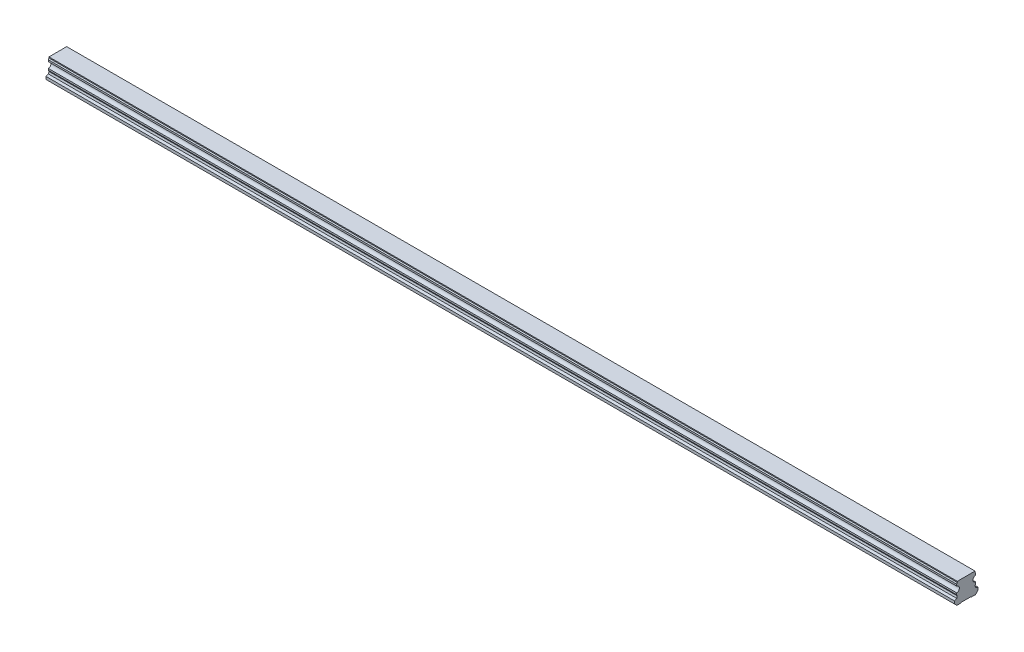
ISO-10303-21;
HEADER;
FILE_DESCRIPTION(('STEP AP214'),'2;1');
FILE_NAME('part.step','',(''),(''),'','','');
FILE_SCHEMA(('AUTOMOTIVE_DESIGN { 1 0 10303 214 1 1 1 1 }'));
ENDSEC;
DATA;
#1=APPLICATION_CONTEXT('core data for automotive mechanical design processes');
#2=APPLICATION_PROTOCOL_DEFINITION('international standard','automotive_design',2000,#1);
#3=PRODUCT_CONTEXT('',#1,'mechanical');
#4=PRODUCT('Part','Part','',(#3));
#5=PRODUCT_RELATED_PRODUCT_CATEGORY('part','',(#4));
#6=PRODUCT_DEFINITION_FORMATION('','',#4);
#7=PRODUCT_DEFINITION_CONTEXT('part definition',#1,'design');
#8=PRODUCT_DEFINITION('design','',#6,#7);
#9=PRODUCT_DEFINITION_SHAPE('','',#8);
#10=(LENGTH_UNIT() NAMED_UNIT(*) SI_UNIT(.MILLI.,.METRE.));
#11=(NAMED_UNIT(*) PLANE_ANGLE_UNIT() SI_UNIT($,.RADIAN.));
#12=(NAMED_UNIT(*) SI_UNIT($,.STERADIAN.) SOLID_ANGLE_UNIT());
#13=UNCERTAINTY_MEASURE_WITH_UNIT(LENGTH_MEASURE(1.E-05),#10,'distance_accuracy_value','');
#14=(GEOMETRIC_REPRESENTATION_CONTEXT(3) GLOBAL_UNCERTAINTY_ASSIGNED_CONTEXT((#13)) GLOBAL_UNIT_ASSIGNED_CONTEXT((#10,
#11,#12)) REPRESENTATION_CONTEXT('',''));
#15=CARTESIAN_POINT('',(0.,0.,0.));
#16=DIRECTION('',(0.,0.,1.));
#17=DIRECTION('',(1.,0.,0.));
#18=AXIS2_PLACEMENT_3D('',#15,#16,#17);
#19=CARTESIAN_POINT('',(930.,0.499999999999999,0.));
#20=DIRECTION('',(0.,-1.,0.));
#21=DIRECTION('',(0.,0.,-1.));
#22=AXIS2_PLACEMENT_3D('',#19,#20,#21);
#23=CONICAL_SURFACE('',#22,3.5,0.785398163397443);
#24=CARTESIAN_POINT('',(930.,1.00000000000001,0.));
#25=DIRECTION('',(0.,1.,0.));
#26=DIRECTION('',(0.,0.,1.));
#27=AXIS2_PLACEMENT_3D('',#24,#25,#26);
#28=CIRCLE('',#27,3.);
#29=CARTESIAN_POINT('',(930.,1.00000000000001,3.));
#30=VERTEX_POINT('',#29);
#31=EDGE_CURVE('E11',#30,#30,#28,.F.);
#32=ORIENTED_EDGE('',*,*,#31,.F.);
#33=EDGE_LOOP('',(#32));
#34=FACE_BOUND('',#33,.T.);
#35=CARTESIAN_POINT('',(930.,0.499999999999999,0.));
#36=DIRECTION('',(0.,1.,0.));
#37=DIRECTION('',(0.,0.,1.));
#38=AXIS2_PLACEMENT_3D('',#35,#36,#37);
#39=CIRCLE('',#38,3.5);
#40=CARTESIAN_POINT('',(930.,0.5,3.5));
#41=VERTEX_POINT('',#40);
#42=EDGE_CURVE('E591',#41,#41,#39,.T.);
#43=ORIENTED_EDGE('',*,*,#42,.F.);
#44=EDGE_LOOP('',(#43));
#45=FACE_BOUND('',#44,.T.);
#46=ADVANCED_FACE('F39',(#34,#45),#23,.F.);
#47=CARTESIAN_POINT('',(930.,12.,0.));
#48=DIRECTION('',(0.,-1.,0.));
#49=DIRECTION('',(0.,0.,-1.));
#50=AXIS2_PLACEMENT_3D('',#47,#48,#49);
#51=CYLINDRICAL_SURFACE('',#50,3.);
#52=ORIENTED_EDGE('',*,*,#31,.T.);
#53=EDGE_LOOP('',(#52));
#54=FACE_BOUND('',#53,.T.);
#55=CARTESIAN_POINT('',(930.,12.,0.));
#56=DIRECTION('',(0.,-1.,0.));
#57=DIRECTION('',(0.,0.,-1.));
#58=AXIS2_PLACEMENT_3D('',#55,#56,#57);
#59=CIRCLE('',#58,3.);
#60=CARTESIAN_POINT('',(930.,12.,-3.));
#61=VERTEX_POINT('',#60);
#62=EDGE_CURVE('E49',#61,#61,#59,.T.);
#63=ORIENTED_EDGE('',*,*,#62,.F.);
#64=EDGE_LOOP('',(#63));
#65=FACE_BOUND('',#64,.T.);
#66=ADVANCED_FACE('F829',(#54,#65),#51,.F.);
#67=CARTESIAN_POINT('',(930.,12.,0.));
#68=DIRECTION('',(0.,-1.,0.));
#69=DIRECTION('',(0.,0.,-1.));
#70=AXIS2_PLACEMENT_3D('',#67,#68,#69);
#71=PLANE('',#70);
#72=CARTESIAN_POINT('',(930.,12.,0.));
#73=DIRECTION('',(0.,-1.,0.));
#74=DIRECTION('',(0.,0.,-1.));
#75=AXIS2_PLACEMENT_3D('',#72,#73,#74);
#76=CIRCLE('',#75,2.5);
#77=CARTESIAN_POINT('',(930.,12.,-2.5));
#78=VERTEX_POINT('',#77);
#79=EDGE_CURVE('E42',#78,#78,#76,.T.);
#80=ORIENTED_EDGE('',*,*,#79,.F.);
#81=EDGE_LOOP('',(#80));
#82=FACE_BOUND('',#81,.T.);
#83=ORIENTED_EDGE('',*,*,#62,.T.);
#84=EDGE_LOOP('',(#83));
#85=FACE_BOUND('',#84,.T.);
#86=ADVANCED_FACE('F834',(#82,#85),#71,.T.);
#87=CARTESIAN_POINT('',(870.,0.499999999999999,0.));
#88=DIRECTION('',(0.,-1.,0.));
#89=DIRECTION('',(0.,0.,-1.));
#90=AXIS2_PLACEMENT_3D('',#87,#88,#89);
#91=CONICAL_SURFACE('',#90,3.5,0.785398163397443);
#92=CARTESIAN_POINT('',(870.,1.00000000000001,0.));
#93=DIRECTION('',(0.,1.,0.));
#94=DIRECTION('',(0.,0.,1.));
#95=AXIS2_PLACEMENT_3D('',#92,#93,#94);
#96=CIRCLE('',#95,3.);
#97=CARTESIAN_POINT('',(870.,1.00000000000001,3.));
#98=VERTEX_POINT('',#97);
#99=EDGE_CURVE('E587',#98,#98,#96,.F.);
#100=ORIENTED_EDGE('',*,*,#99,.F.);
#101=EDGE_LOOP('',(#100));
#102=FACE_BOUND('',#101,.T.);
#103=CARTESIAN_POINT('',(870.,0.499999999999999,0.));
#104=DIRECTION('',(0.,1.,0.));
#105=DIRECTION('',(0.,0.,1.));
#106=AXIS2_PLACEMENT_3D('',#103,#104,#105);
#107=CIRCLE('',#106,3.5);
#108=CARTESIAN_POINT('',(870.,0.5,3.5));
#109=VERTEX_POINT('',#108);
#110=EDGE_CURVE('E579',#109,#109,#107,.T.);
#111=ORIENTED_EDGE('',*,*,#110,.F.);
#112=EDGE_LOOP('',(#111));
#113=FACE_BOUND('',#112,.T.);
#114=ADVANCED_FACE('F1065',(#102,#113),#91,.F.);
#115=CARTESIAN_POINT('',(870.,12.,0.));
#116=DIRECTION('',(0.,-1.,0.));
#117=DIRECTION('',(0.,0.,-1.));
#118=AXIS2_PLACEMENT_3D('',#115,#116,#117);
#119=CYLINDRICAL_SURFACE('',#118,3.);
#120=ORIENTED_EDGE('',*,*,#99,.T.);
#121=EDGE_LOOP('',(#120));
#122=FACE_BOUND('',#121,.T.);
#123=CARTESIAN_POINT('',(870.,12.,0.));
#124=DIRECTION('',(0.,-1.,0.));
#125=DIRECTION('',(0.,0.,-1.));
#126=AXIS2_PLACEMENT_3D('',#123,#124,#125);
#127=CIRCLE('',#126,3.);
#128=CARTESIAN_POINT('',(870.,12.,-3.));
#129=VERTEX_POINT('',#128);
#130=EDGE_CURVE('E583',#129,#129,#127,.T.);
#131=ORIENTED_EDGE('',*,*,#130,.F.);
#132=EDGE_LOOP('',(#131));
#133=FACE_BOUND('',#132,.T.);
#134=ADVANCED_FACE('F1061',(#122,#133),#119,.F.);
#135=CARTESIAN_POINT('',(870.,12.,0.));
#136=DIRECTION('',(0.,-1.,0.));
#137=DIRECTION('',(0.,0.,-1.));
#138=AXIS2_PLACEMENT_3D('',#135,#136,#137);
#139=PLANE('',#138);
#140=CARTESIAN_POINT('',(870.,12.,0.));
#141=DIRECTION('',(0.,-1.,0.));
#142=DIRECTION('',(0.,0.,-1.));
#143=AXIS2_PLACEMENT_3D('',#140,#141,#142);
#144=CIRCLE('',#143,2.5);
#145=CARTESIAN_POINT('',(870.,12.,-2.5));
#146=VERTEX_POINT('',#145);
#147=EDGE_CURVE('E650',#146,#146,#144,.T.);
#148=ORIENTED_EDGE('',*,*,#147,.F.);
#149=EDGE_LOOP('',(#148));
#150=FACE_BOUND('',#149,.T.);
#151=ORIENTED_EDGE('',*,*,#130,.T.);
#152=EDGE_LOOP('',(#151));
#153=FACE_BOUND('',#152,.T.);
#154=ADVANCED_FACE('F1057',(#150,#153),#139,.T.);
#155=CARTESIAN_POINT('',(810.,0.499999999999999,0.));
#156=DIRECTION('',(0.,-1.,0.));
#157=DIRECTION('',(0.,0.,-1.));
#158=AXIS2_PLACEMENT_3D('',#155,#156,#157);
#159=CONICAL_SURFACE('',#158,3.5,0.785398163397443);
#160=CARTESIAN_POINT('',(810.,1.00000000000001,0.));
#161=DIRECTION('',(0.,1.,0.));
#162=DIRECTION('',(0.,0.,1.));
#163=AXIS2_PLACEMENT_3D('',#160,#161,#162);
#164=CIRCLE('',#163,3.);
#165=CARTESIAN_POINT('',(810.,1.00000000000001,3.));
#166=VERTEX_POINT('',#165);
#167=EDGE_CURVE('E575',#166,#166,#164,.F.);
#168=ORIENTED_EDGE('',*,*,#167,.F.);
#169=EDGE_LOOP('',(#168));
#170=FACE_BOUND('',#169,.T.);
#171=CARTESIAN_POINT('',(810.,0.499999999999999,0.));
#172=DIRECTION('',(0.,1.,0.));
#173=DIRECTION('',(0.,0.,1.));
#174=AXIS2_PLACEMENT_3D('',#171,#172,#173);
#175=CIRCLE('',#174,3.5);
#176=CARTESIAN_POINT('',(810.,0.5,3.5));
#177=VERTEX_POINT('',#176);
#178=EDGE_CURVE('E567',#177,#177,#175,.T.);
#179=ORIENTED_EDGE('',*,*,#178,.F.);
#180=EDGE_LOOP('',(#179));
#181=FACE_BOUND('',#180,.T.);
#182=ADVANCED_FACE('F1053',(#170,#181),#159,.F.);
#183=CARTESIAN_POINT('',(810.,12.,0.));
#184=DIRECTION('',(0.,-1.,0.));
#185=DIRECTION('',(0.,0.,-1.));
#186=AXIS2_PLACEMENT_3D('',#183,#184,#185);
#187=CYLINDRICAL_SURFACE('',#186,3.);
#188=ORIENTED_EDGE('',*,*,#167,.T.);
#189=EDGE_LOOP('',(#188));
#190=FACE_BOUND('',#189,.T.);
#191=CARTESIAN_POINT('',(810.,12.,0.));
#192=DIRECTION('',(0.,-1.,0.));
#193=DIRECTION('',(0.,0.,-1.));
#194=AXIS2_PLACEMENT_3D('',#191,#192,#193);
#195=CIRCLE('',#194,3.);
#196=CARTESIAN_POINT('',(810.,12.,-3.));
#197=VERTEX_POINT('',#196);
#198=EDGE_CURVE('E571',#197,#197,#195,.T.);
#199=ORIENTED_EDGE('',*,*,#198,.F.);
#200=EDGE_LOOP('',(#199));
#201=FACE_BOUND('',#200,.T.);
#202=ADVANCED_FACE('F1049',(#190,#201),#187,.F.);
#203=CARTESIAN_POINT('',(810.,12.,0.));
#204=DIRECTION('',(0.,-1.,0.));
#205=DIRECTION('',(0.,0.,-1.));
#206=AXIS2_PLACEMENT_3D('',#203,#204,#205);
#207=PLANE('',#206);
#208=CARTESIAN_POINT('',(810.,12.,0.));
#209=DIRECTION('',(0.,-1.,0.));
#210=DIRECTION('',(0.,0.,-1.));
#211=AXIS2_PLACEMENT_3D('',#208,#209,#210);
#212=CIRCLE('',#211,2.5);
#213=CARTESIAN_POINT('',(810.,12.,-2.5));
#214=VERTEX_POINT('',#213);
#215=EDGE_CURVE('E647',#214,#214,#212,.T.);
#216=ORIENTED_EDGE('',*,*,#215,.F.);
#217=EDGE_LOOP('',(#216));
#218=FACE_BOUND('',#217,.T.);
#219=ORIENTED_EDGE('',*,*,#198,.T.);
#220=EDGE_LOOP('',(#219));
#221=FACE_BOUND('',#220,.T.);
#222=ADVANCED_FACE('F1045',(#218,#221),#207,.T.);
#223=CARTESIAN_POINT('',(750.,0.499999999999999,0.));
#224=DIRECTION('',(0.,-1.,0.));
#225=DIRECTION('',(0.,0.,-1.));
#226=AXIS2_PLACEMENT_3D('',#223,#224,#225);
#227=CONICAL_SURFACE('',#226,3.5,0.785398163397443);
#228=CARTESIAN_POINT('',(750.,1.00000000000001,0.));
#229=DIRECTION('',(0.,1.,0.));
#230=DIRECTION('',(0.,0.,1.));
#231=AXIS2_PLACEMENT_3D('',#228,#229,#230);
#232=CIRCLE('',#231,3.);
#233=CARTESIAN_POINT('',(750.,1.00000000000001,3.));
#234=VERTEX_POINT('',#233);
#235=EDGE_CURVE('E563',#234,#234,#232,.F.);
#236=ORIENTED_EDGE('',*,*,#235,.F.);
#237=EDGE_LOOP('',(#236));
#238=FACE_BOUND('',#237,.T.);
#239=CARTESIAN_POINT('',(750.,0.499999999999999,0.));
#240=DIRECTION('',(0.,1.,0.));
#241=DIRECTION('',(0.,0.,1.));
#242=AXIS2_PLACEMENT_3D('',#239,#240,#241);
#243=CIRCLE('',#242,3.5);
#244=CARTESIAN_POINT('',(750.,0.5,3.5));
#245=VERTEX_POINT('',#244);
#246=EDGE_CURVE('E555',#245,#245,#243,.T.);
#247=ORIENTED_EDGE('',*,*,#246,.F.);
#248=EDGE_LOOP('',(#247));
#249=FACE_BOUND('',#248,.T.);
#250=ADVANCED_FACE('F1041',(#238,#249),#227,.F.);
#251=CARTESIAN_POINT('',(750.,12.,0.));
#252=DIRECTION('',(0.,-1.,0.));
#253=DIRECTION('',(0.,0.,-1.));
#254=AXIS2_PLACEMENT_3D('',#251,#252,#253);
#255=CYLINDRICAL_SURFACE('',#254,3.);
#256=ORIENTED_EDGE('',*,*,#235,.T.);
#257=EDGE_LOOP('',(#256));
#258=FACE_BOUND('',#257,.T.);
#259=CARTESIAN_POINT('',(750.,12.,0.));
#260=DIRECTION('',(0.,-1.,0.));
#261=DIRECTION('',(0.,0.,-1.));
#262=AXIS2_PLACEMENT_3D('',#259,#260,#261);
#263=CIRCLE('',#262,3.);
#264=CARTESIAN_POINT('',(750.,12.,-3.));
#265=VERTEX_POINT('',#264);
#266=EDGE_CURVE('E559',#265,#265,#263,.T.);
#267=ORIENTED_EDGE('',*,*,#266,.F.);
#268=EDGE_LOOP('',(#267));
#269=FACE_BOUND('',#268,.T.);
#270=ADVANCED_FACE('F1037',(#258,#269),#255,.F.);
#271=CARTESIAN_POINT('',(750.,12.,0.));
#272=DIRECTION('',(0.,-1.,0.));
#273=DIRECTION('',(0.,0.,-1.));
#274=AXIS2_PLACEMENT_3D('',#271,#272,#273);
#275=PLANE('',#274);
#276=CARTESIAN_POINT('',(750.,12.,0.));
#277=DIRECTION('',(0.,-1.,0.));
#278=DIRECTION('',(0.,0.,-1.));
#279=AXIS2_PLACEMENT_3D('',#276,#277,#278);
#280=CIRCLE('',#279,2.5);
#281=CARTESIAN_POINT('',(750.,12.,-2.5));
#282=VERTEX_POINT('',#281);
#283=EDGE_CURVE('E643',#282,#282,#280,.T.);
#284=ORIENTED_EDGE('',*,*,#283,.F.);
#285=EDGE_LOOP('',(#284));
#286=FACE_BOUND('',#285,.T.);
#287=ORIENTED_EDGE('',*,*,#266,.T.);
#288=EDGE_LOOP('',(#287));
#289=FACE_BOUND('',#288,.T.);
#290=ADVANCED_FACE('F1033',(#286,#289),#275,.T.);
#291=CARTESIAN_POINT('',(690.,0.499999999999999,0.));
#292=DIRECTION('',(0.,-1.,0.));
#293=DIRECTION('',(0.,0.,-1.));
#294=AXIS2_PLACEMENT_3D('',#291,#292,#293);
#295=CONICAL_SURFACE('',#294,3.5,0.785398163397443);
#296=CARTESIAN_POINT('',(690.,1.00000000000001,0.));
#297=DIRECTION('',(0.,1.,0.));
#298=DIRECTION('',(0.,0.,1.));
#299=AXIS2_PLACEMENT_3D('',#296,#297,#298);
#300=CIRCLE('',#299,3.);
#301=CARTESIAN_POINT('',(690.,1.00000000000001,3.));
#302=VERTEX_POINT('',#301);
#303=EDGE_CURVE('E551',#302,#302,#300,.F.);
#304=ORIENTED_EDGE('',*,*,#303,.F.);
#305=EDGE_LOOP('',(#304));
#306=FACE_BOUND('',#305,.T.);
#307=CARTESIAN_POINT('',(690.,0.499999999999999,0.));
#308=DIRECTION('',(0.,1.,0.));
#309=DIRECTION('',(0.,0.,1.));
#310=AXIS2_PLACEMENT_3D('',#307,#308,#309);
#311=CIRCLE('',#310,3.5);
#312=CARTESIAN_POINT('',(690.,0.5,3.5));
#313=VERTEX_POINT('',#312);
#314=EDGE_CURVE('E543',#313,#313,#311,.T.);
#315=ORIENTED_EDGE('',*,*,#314,.F.);
#316=EDGE_LOOP('',(#315));
#317=FACE_BOUND('',#316,.T.);
#318=ADVANCED_FACE('F1029',(#306,#317),#295,.F.);
#319=CARTESIAN_POINT('',(690.,12.,0.));
#320=DIRECTION('',(0.,-1.,0.));
#321=DIRECTION('',(0.,0.,-1.));
#322=AXIS2_PLACEMENT_3D('',#319,#320,#321);
#323=CYLINDRICAL_SURFACE('',#322,3.);
#324=ORIENTED_EDGE('',*,*,#303,.T.);
#325=EDGE_LOOP('',(#324));
#326=FACE_BOUND('',#325,.T.);
#327=CARTESIAN_POINT('',(690.,12.,0.));
#328=DIRECTION('',(0.,-1.,0.));
#329=DIRECTION('',(0.,0.,-1.));
#330=AXIS2_PLACEMENT_3D('',#327,#328,#329);
#331=CIRCLE('',#330,3.);
#332=CARTESIAN_POINT('',(690.,12.,-3.));
#333=VERTEX_POINT('',#332);
#334=EDGE_CURVE('E547',#333,#333,#331,.T.);
#335=ORIENTED_EDGE('',*,*,#334,.F.);
#336=EDGE_LOOP('',(#335));
#337=FACE_BOUND('',#336,.T.);
#338=ADVANCED_FACE('F1025',(#326,#337),#323,.F.);
#339=CARTESIAN_POINT('',(690.,12.,0.));
#340=DIRECTION('',(0.,-1.,0.));
#341=DIRECTION('',(0.,0.,-1.));
#342=AXIS2_PLACEMENT_3D('',#339,#340,#341);
#343=PLANE('',#342);
#344=CARTESIAN_POINT('',(690.,12.,0.));
#345=DIRECTION('',(0.,-1.,0.));
#346=DIRECTION('',(0.,0.,-1.));
#347=AXIS2_PLACEMENT_3D('',#344,#345,#346);
#348=CIRCLE('',#347,2.5);
#349=CARTESIAN_POINT('',(690.,12.,-2.5));
#350=VERTEX_POINT('',#349);
#351=EDGE_CURVE('E639',#350,#350,#348,.T.);
#352=ORIENTED_EDGE('',*,*,#351,.F.);
#353=EDGE_LOOP('',(#352));
#354=FACE_BOUND('',#353,.T.);
#355=ORIENTED_EDGE('',*,*,#334,.T.);
#356=EDGE_LOOP('',(#355));
#357=FACE_BOUND('',#356,.T.);
#358=ADVANCED_FACE('F1021',(#354,#357),#343,.T.);
#359=CARTESIAN_POINT('',(630.,0.499999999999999,0.));
#360=DIRECTION('',(0.,-1.,0.));
#361=DIRECTION('',(0.,0.,-1.));
#362=AXIS2_PLACEMENT_3D('',#359,#360,#361);
#363=CONICAL_SURFACE('',#362,3.5,0.785398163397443);
#364=CARTESIAN_POINT('',(630.,1.00000000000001,0.));
#365=DIRECTION('',(0.,1.,0.));
#366=DIRECTION('',(0.,0.,1.));
#367=AXIS2_PLACEMENT_3D('',#364,#365,#366);
#368=CIRCLE('',#367,3.);
#369=CARTESIAN_POINT('',(630.,1.00000000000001,3.));
#370=VERTEX_POINT('',#369);
#371=EDGE_CURVE('E539',#370,#370,#368,.F.);
#372=ORIENTED_EDGE('',*,*,#371,.F.);
#373=EDGE_LOOP('',(#372));
#374=FACE_BOUND('',#373,.T.);
#375=CARTESIAN_POINT('',(630.,0.499999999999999,0.));
#376=DIRECTION('',(0.,1.,0.));
#377=DIRECTION('',(0.,0.,1.));
#378=AXIS2_PLACEMENT_3D('',#375,#376,#377);
#379=CIRCLE('',#378,3.5);
#380=CARTESIAN_POINT('',(630.,0.5,3.5));
#381=VERTEX_POINT('',#380);
#382=EDGE_CURVE('E531',#381,#381,#379,.T.);
#383=ORIENTED_EDGE('',*,*,#382,.F.);
#384=EDGE_LOOP('',(#383));
#385=FACE_BOUND('',#384,.T.);
#386=ADVANCED_FACE('F1017',(#374,#385),#363,.F.);
#387=CARTESIAN_POINT('',(630.,12.,0.));
#388=DIRECTION('',(0.,-1.,0.));
#389=DIRECTION('',(0.,0.,-1.));
#390=AXIS2_PLACEMENT_3D('',#387,#388,#389);
#391=CYLINDRICAL_SURFACE('',#390,3.);
#392=ORIENTED_EDGE('',*,*,#371,.T.);
#393=EDGE_LOOP('',(#392));
#394=FACE_BOUND('',#393,.T.);
#395=CARTESIAN_POINT('',(630.,12.,0.));
#396=DIRECTION('',(0.,-1.,0.));
#397=DIRECTION('',(0.,0.,-1.));
#398=AXIS2_PLACEMENT_3D('',#395,#396,#397);
#399=CIRCLE('',#398,3.);
#400=CARTESIAN_POINT('',(630.,12.,-3.));
#401=VERTEX_POINT('',#400);
#402=EDGE_CURVE('E535',#401,#401,#399,.T.);
#403=ORIENTED_EDGE('',*,*,#402,.F.);
#404=EDGE_LOOP('',(#403));
#405=FACE_BOUND('',#404,.T.);
#406=ADVANCED_FACE('F1013',(#394,#405),#391,.F.);
#407=CARTESIAN_POINT('',(630.,12.,0.));
#408=DIRECTION('',(0.,-1.,0.));
#409=DIRECTION('',(0.,0.,-1.));
#410=AXIS2_PLACEMENT_3D('',#407,#408,#409);
#411=PLANE('',#410);
#412=CARTESIAN_POINT('',(630.,12.,0.));
#413=DIRECTION('',(0.,-1.,0.));
#414=DIRECTION('',(0.,0.,-1.));
#415=AXIS2_PLACEMENT_3D('',#412,#413,#414);
#416=CIRCLE('',#415,2.5);
#417=CARTESIAN_POINT('',(630.,12.,-2.5));
#418=VERTEX_POINT('',#417);
#419=EDGE_CURVE('E635',#418,#418,#416,.T.);
#420=ORIENTED_EDGE('',*,*,#419,.F.);
#421=EDGE_LOOP('',(#420));
#422=FACE_BOUND('',#421,.T.);
#423=ORIENTED_EDGE('',*,*,#402,.T.);
#424=EDGE_LOOP('',(#423));
#425=FACE_BOUND('',#424,.T.);
#426=ADVANCED_FACE('F1009',(#422,#425),#411,.T.);
#427=CARTESIAN_POINT('',(570.,0.499999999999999,0.));
#428=DIRECTION('',(0.,-1.,0.));
#429=DIRECTION('',(0.,0.,-1.));
#430=AXIS2_PLACEMENT_3D('',#427,#428,#429);
#431=CONICAL_SURFACE('',#430,3.5,0.785398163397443);
#432=CARTESIAN_POINT('',(570.,1.00000000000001,0.));
#433=DIRECTION('',(0.,1.,0.));
#434=DIRECTION('',(0.,0.,1.));
#435=AXIS2_PLACEMENT_3D('',#432,#433,#434);
#436=CIRCLE('',#435,3.);
#437=CARTESIAN_POINT('',(570.,1.00000000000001,3.));
#438=VERTEX_POINT('',#437);
#439=EDGE_CURVE('E527',#438,#438,#436,.F.);
#440=ORIENTED_EDGE('',*,*,#439,.F.);
#441=EDGE_LOOP('',(#440));
#442=FACE_BOUND('',#441,.T.);
#443=CARTESIAN_POINT('',(570.,0.499999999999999,0.));
#444=DIRECTION('',(0.,1.,0.));
#445=DIRECTION('',(0.,0.,1.));
#446=AXIS2_PLACEMENT_3D('',#443,#444,#445);
#447=CIRCLE('',#446,3.5);
#448=CARTESIAN_POINT('',(570.,0.5,3.5));
#449=VERTEX_POINT('',#448);
#450=EDGE_CURVE('E519',#449,#449,#447,.T.);
#451=ORIENTED_EDGE('',*,*,#450,.F.);
#452=EDGE_LOOP('',(#451));
#453=FACE_BOUND('',#452,.T.);
#454=ADVANCED_FACE('F1005',(#442,#453),#431,.F.);
#455=CARTESIAN_POINT('',(570.,12.,0.));
#456=DIRECTION('',(0.,-1.,0.));
#457=DIRECTION('',(0.,0.,-1.));
#458=AXIS2_PLACEMENT_3D('',#455,#456,#457);
#459=CYLINDRICAL_SURFACE('',#458,3.);
#460=ORIENTED_EDGE('',*,*,#439,.T.);
#461=EDGE_LOOP('',(#460));
#462=FACE_BOUND('',#461,.T.);
#463=CARTESIAN_POINT('',(570.,12.,0.));
#464=DIRECTION('',(0.,-1.,0.));
#465=DIRECTION('',(0.,0.,-1.));
#466=AXIS2_PLACEMENT_3D('',#463,#464,#465);
#467=CIRCLE('',#466,3.);
#468=CARTESIAN_POINT('',(570.,12.,-3.));
#469=VERTEX_POINT('',#468);
#470=EDGE_CURVE('E523',#469,#469,#467,.T.);
#471=ORIENTED_EDGE('',*,*,#470,.F.);
#472=EDGE_LOOP('',(#471));
#473=FACE_BOUND('',#472,.T.);
#474=ADVANCED_FACE('F1001',(#462,#473),#459,.F.);
#475=CARTESIAN_POINT('',(570.,12.,0.));
#476=DIRECTION('',(0.,-1.,0.));
#477=DIRECTION('',(0.,0.,-1.));
#478=AXIS2_PLACEMENT_3D('',#475,#476,#477);
#479=PLANE('',#478);
#480=CARTESIAN_POINT('',(570.,12.,0.));
#481=DIRECTION('',(0.,-1.,0.));
#482=DIRECTION('',(0.,0.,-1.));
#483=AXIS2_PLACEMENT_3D('',#480,#481,#482);
#484=CIRCLE('',#483,2.5);
#485=CARTESIAN_POINT('',(570.,12.,-2.5));
#486=VERTEX_POINT('',#485);
#487=EDGE_CURVE('E631',#486,#486,#484,.T.);
#488=ORIENTED_EDGE('',*,*,#487,.F.);
#489=EDGE_LOOP('',(#488));
#490=FACE_BOUND('',#489,.T.);
#491=ORIENTED_EDGE('',*,*,#470,.T.);
#492=EDGE_LOOP('',(#491));
#493=FACE_BOUND('',#492,.T.);
#494=ADVANCED_FACE('F997',(#490,#493),#479,.T.);
#495=CARTESIAN_POINT('',(510.,0.499999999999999,0.));
#496=DIRECTION('',(0.,-1.,0.));
#497=DIRECTION('',(0.,0.,-1.));
#498=AXIS2_PLACEMENT_3D('',#495,#496,#497);
#499=CONICAL_SURFACE('',#498,3.5,0.785398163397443);
#500=CARTESIAN_POINT('',(510.,1.00000000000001,0.));
#501=DIRECTION('',(0.,1.,0.));
#502=DIRECTION('',(0.,0.,1.));
#503=AXIS2_PLACEMENT_3D('',#500,#501,#502);
#504=CIRCLE('',#503,3.);
#505=CARTESIAN_POINT('',(510.,1.00000000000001,3.));
#506=VERTEX_POINT('',#505);
#507=EDGE_CURVE('E515',#506,#506,#504,.F.);
#508=ORIENTED_EDGE('',*,*,#507,.F.);
#509=EDGE_LOOP('',(#508));
#510=FACE_BOUND('',#509,.T.);
#511=CARTESIAN_POINT('',(510.,0.499999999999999,0.));
#512=DIRECTION('',(0.,1.,0.));
#513=DIRECTION('',(0.,0.,1.));
#514=AXIS2_PLACEMENT_3D('',#511,#512,#513);
#515=CIRCLE('',#514,3.5);
#516=CARTESIAN_POINT('',(510.,0.5,3.5));
#517=VERTEX_POINT('',#516);
#518=EDGE_CURVE('E507',#517,#517,#515,.T.);
#519=ORIENTED_EDGE('',*,*,#518,.F.);
#520=EDGE_LOOP('',(#519));
#521=FACE_BOUND('',#520,.T.);
#522=ADVANCED_FACE('F993',(#510,#521),#499,.F.);
#523=CARTESIAN_POINT('',(510.,12.,0.));
#524=DIRECTION('',(0.,-1.,0.));
#525=DIRECTION('',(0.,0.,-1.));
#526=AXIS2_PLACEMENT_3D('',#523,#524,#525);
#527=CYLINDRICAL_SURFACE('',#526,3.);
#528=ORIENTED_EDGE('',*,*,#507,.T.);
#529=EDGE_LOOP('',(#528));
#530=FACE_BOUND('',#529,.T.);
#531=CARTESIAN_POINT('',(510.,12.,0.));
#532=DIRECTION('',(0.,-1.,0.));
#533=DIRECTION('',(0.,0.,-1.));
#534=AXIS2_PLACEMENT_3D('',#531,#532,#533);
#535=CIRCLE('',#534,3.);
#536=CARTESIAN_POINT('',(510.,12.,-3.));
#537=VERTEX_POINT('',#536);
#538=EDGE_CURVE('E511',#537,#537,#535,.T.);
#539=ORIENTED_EDGE('',*,*,#538,.F.);
#540=EDGE_LOOP('',(#539));
#541=FACE_BOUND('',#540,.T.);
#542=ADVANCED_FACE('F989',(#530,#541),#527,.F.);
#543=CARTESIAN_POINT('',(510.,12.,0.));
#544=DIRECTION('',(0.,-1.,0.));
#545=DIRECTION('',(0.,0.,-1.));
#546=AXIS2_PLACEMENT_3D('',#543,#544,#545);
#547=PLANE('',#546);
#548=CARTESIAN_POINT('',(510.,12.,0.));
#549=DIRECTION('',(0.,-1.,0.));
#550=DIRECTION('',(0.,0.,-1.));
#551=AXIS2_PLACEMENT_3D('',#548,#549,#550);
#552=CIRCLE('',#551,2.5);
#553=CARTESIAN_POINT('',(510.,12.,-2.5));
#554=VERTEX_POINT('',#553);
#555=EDGE_CURVE('E627',#554,#554,#552,.T.);
#556=ORIENTED_EDGE('',*,*,#555,.F.);
#557=EDGE_LOOP('',(#556));
#558=FACE_BOUND('',#557,.T.);
#559=ORIENTED_EDGE('',*,*,#538,.T.);
#560=EDGE_LOOP('',(#559));
#561=FACE_BOUND('',#560,.T.);
#562=ADVANCED_FACE('F985',(#558,#561),#547,.T.);
#563=CARTESIAN_POINT('',(450.,0.499999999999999,0.));
#564=DIRECTION('',(0.,-1.,0.));
#565=DIRECTION('',(0.,0.,-1.));
#566=AXIS2_PLACEMENT_3D('',#563,#564,#565);
#567=CONICAL_SURFACE('',#566,3.5,0.785398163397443);
#568=CARTESIAN_POINT('',(450.,1.00000000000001,0.));
#569=DIRECTION('',(0.,1.,0.));
#570=DIRECTION('',(0.,0.,1.));
#571=AXIS2_PLACEMENT_3D('',#568,#569,#570);
#572=CIRCLE('',#571,3.);
#573=CARTESIAN_POINT('',(450.,1.00000000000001,3.));
#574=VERTEX_POINT('',#573);
#575=EDGE_CURVE('E503',#574,#574,#572,.F.);
#576=ORIENTED_EDGE('',*,*,#575,.F.);
#577=EDGE_LOOP('',(#576));
#578=FACE_BOUND('',#577,.T.);
#579=CARTESIAN_POINT('',(450.,0.499999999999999,0.));
#580=DIRECTION('',(0.,1.,0.));
#581=DIRECTION('',(0.,0.,1.));
#582=AXIS2_PLACEMENT_3D('',#579,#580,#581);
#583=CIRCLE('',#582,3.5);
#584=CARTESIAN_POINT('',(450.,0.5,3.5));
#585=VERTEX_POINT('',#584);
#586=EDGE_CURVE('E495',#585,#585,#583,.T.);
#587=ORIENTED_EDGE('',*,*,#586,.F.);
#588=EDGE_LOOP('',(#587));
#589=FACE_BOUND('',#588,.T.);
#590=ADVANCED_FACE('F981',(#578,#589),#567,.F.);
#591=CARTESIAN_POINT('',(450.,12.,0.));
#592=DIRECTION('',(0.,-1.,0.));
#593=DIRECTION('',(0.,0.,-1.));
#594=AXIS2_PLACEMENT_3D('',#591,#592,#593);
#595=CYLINDRICAL_SURFACE('',#594,3.);
#596=ORIENTED_EDGE('',*,*,#575,.T.);
#597=EDGE_LOOP('',(#596));
#598=FACE_BOUND('',#597,.T.);
#599=CARTESIAN_POINT('',(450.,12.,0.));
#600=DIRECTION('',(0.,-1.,0.));
#601=DIRECTION('',(0.,0.,-1.));
#602=AXIS2_PLACEMENT_3D('',#599,#600,#601);
#603=CIRCLE('',#602,3.);
#604=CARTESIAN_POINT('',(450.,12.,-3.));
#605=VERTEX_POINT('',#604);
#606=EDGE_CURVE('E499',#605,#605,#603,.T.);
#607=ORIENTED_EDGE('',*,*,#606,.F.);
#608=EDGE_LOOP('',(#607));
#609=FACE_BOUND('',#608,.T.);
#610=ADVANCED_FACE('F977',(#598,#609),#595,.F.);
#611=CARTESIAN_POINT('',(450.,12.,0.));
#612=DIRECTION('',(0.,-1.,0.));
#613=DIRECTION('',(0.,0.,-1.));
#614=AXIS2_PLACEMENT_3D('',#611,#612,#613);
#615=PLANE('',#614);
#616=CARTESIAN_POINT('',(450.,12.,0.));
#617=DIRECTION('',(0.,-1.,0.));
#618=DIRECTION('',(0.,0.,-1.));
#619=AXIS2_PLACEMENT_3D('',#616,#617,#618);
#620=CIRCLE('',#619,2.5);
#621=CARTESIAN_POINT('',(450.,12.,-2.5));
#622=VERTEX_POINT('',#621);
#623=EDGE_CURVE('E623',#622,#622,#620,.T.);
#624=ORIENTED_EDGE('',*,*,#623,.F.);
#625=EDGE_LOOP('',(#624));
#626=FACE_BOUND('',#625,.T.);
#627=ORIENTED_EDGE('',*,*,#606,.T.);
#628=EDGE_LOOP('',(#627));
#629=FACE_BOUND('',#628,.T.);
#630=ADVANCED_FACE('F973',(#626,#629),#615,.T.);
#631=CARTESIAN_POINT('',(390.,0.499999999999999,0.));
#632=DIRECTION('',(0.,-1.,0.));
#633=DIRECTION('',(0.,0.,-1.));
#634=AXIS2_PLACEMENT_3D('',#631,#632,#633);
#635=CONICAL_SURFACE('',#634,3.5,0.785398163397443);
#636=CARTESIAN_POINT('',(390.,1.00000000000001,0.));
#637=DIRECTION('',(0.,1.,0.));
#638=DIRECTION('',(0.,0.,1.));
#639=AXIS2_PLACEMENT_3D('',#636,#637,#638);
#640=CIRCLE('',#639,3.);
#641=CARTESIAN_POINT('',(390.,1.00000000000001,3.));
#642=VERTEX_POINT('',#641);
#643=EDGE_CURVE('E491',#642,#642,#640,.F.);
#644=ORIENTED_EDGE('',*,*,#643,.F.);
#645=EDGE_LOOP('',(#644));
#646=FACE_BOUND('',#645,.T.);
#647=CARTESIAN_POINT('',(390.,0.499999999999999,0.));
#648=DIRECTION('',(0.,1.,0.));
#649=DIRECTION('',(0.,0.,1.));
#650=AXIS2_PLACEMENT_3D('',#647,#648,#649);
#651=CIRCLE('',#650,3.5);
#652=CARTESIAN_POINT('',(390.,0.5,3.5));
#653=VERTEX_POINT('',#652);
#654=EDGE_CURVE('E483',#653,#653,#651,.T.);
#655=ORIENTED_EDGE('',*,*,#654,.F.);
#656=EDGE_LOOP('',(#655));
#657=FACE_BOUND('',#656,.T.);
#658=ADVANCED_FACE('F969',(#646,#657),#635,.F.);
#659=CARTESIAN_POINT('',(390.,12.,0.));
#660=DIRECTION('',(0.,-1.,0.));
#661=DIRECTION('',(0.,0.,-1.));
#662=AXIS2_PLACEMENT_3D('',#659,#660,#661);
#663=CYLINDRICAL_SURFACE('',#662,3.);
#664=ORIENTED_EDGE('',*,*,#643,.T.);
#665=EDGE_LOOP('',(#664));
#666=FACE_BOUND('',#665,.T.);
#667=CARTESIAN_POINT('',(390.,12.,0.));
#668=DIRECTION('',(0.,-1.,0.));
#669=DIRECTION('',(0.,0.,-1.));
#670=AXIS2_PLACEMENT_3D('',#667,#668,#669);
#671=CIRCLE('',#670,3.);
#672=CARTESIAN_POINT('',(390.,12.,-3.));
#673=VERTEX_POINT('',#672);
#674=EDGE_CURVE('E487',#673,#673,#671,.T.);
#675=ORIENTED_EDGE('',*,*,#674,.F.);
#676=EDGE_LOOP('',(#675));
#677=FACE_BOUND('',#676,.T.);
#678=ADVANCED_FACE('F965',(#666,#677),#663,.F.);
#679=CARTESIAN_POINT('',(390.,12.,0.));
#680=DIRECTION('',(0.,-1.,0.));
#681=DIRECTION('',(0.,0.,-1.));
#682=AXIS2_PLACEMENT_3D('',#679,#680,#681);
#683=PLANE('',#682);
#684=CARTESIAN_POINT('',(390.,12.,0.));
#685=DIRECTION('',(0.,-1.,0.));
#686=DIRECTION('',(0.,0.,-1.));
#687=AXIS2_PLACEMENT_3D('',#684,#685,#686);
#688=CIRCLE('',#687,2.5);
#689=CARTESIAN_POINT('',(390.,12.,-2.5));
#690=VERTEX_POINT('',#689);
#691=EDGE_CURVE('E619',#690,#690,#688,.T.);
#692=ORIENTED_EDGE('',*,*,#691,.F.);
#693=EDGE_LOOP('',(#692));
#694=FACE_BOUND('',#693,.T.);
#695=ORIENTED_EDGE('',*,*,#674,.T.);
#696=EDGE_LOOP('',(#695));
#697=FACE_BOUND('',#696,.T.);
#698=ADVANCED_FACE('F961',(#694,#697),#683,.T.);
#699=CARTESIAN_POINT('',(330.,0.499999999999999,0.));
#700=DIRECTION('',(0.,-1.,0.));
#701=DIRECTION('',(0.,0.,-1.));
#702=AXIS2_PLACEMENT_3D('',#699,#700,#701);
#703=CONICAL_SURFACE('',#702,3.5,0.785398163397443);
#704=CARTESIAN_POINT('',(330.,1.00000000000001,0.));
#705=DIRECTION('',(0.,1.,0.));
#706=DIRECTION('',(0.,0.,1.));
#707=AXIS2_PLACEMENT_3D('',#704,#705,#706);
#708=CIRCLE('',#707,3.);
#709=CARTESIAN_POINT('',(330.,1.00000000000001,3.));
#710=VERTEX_POINT('',#709);
#711=EDGE_CURVE('E479',#710,#710,#708,.F.);
#712=ORIENTED_EDGE('',*,*,#711,.F.);
#713=EDGE_LOOP('',(#712));
#714=FACE_BOUND('',#713,.T.);
#715=CARTESIAN_POINT('',(330.,0.499999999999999,0.));
#716=DIRECTION('',(0.,1.,0.));
#717=DIRECTION('',(0.,0.,1.));
#718=AXIS2_PLACEMENT_3D('',#715,#716,#717);
#719=CIRCLE('',#718,3.5);
#720=CARTESIAN_POINT('',(330.,0.5,3.5));
#721=VERTEX_POINT('',#720);
#722=EDGE_CURVE('E471',#721,#721,#719,.T.);
#723=ORIENTED_EDGE('',*,*,#722,.F.);
#724=EDGE_LOOP('',(#723));
#725=FACE_BOUND('',#724,.T.);
#726=ADVANCED_FACE('F957',(#714,#725),#703,.F.);
#727=CARTESIAN_POINT('',(330.,12.,0.));
#728=DIRECTION('',(0.,-1.,0.));
#729=DIRECTION('',(0.,0.,-1.));
#730=AXIS2_PLACEMENT_3D('',#727,#728,#729);
#731=CYLINDRICAL_SURFACE('',#730,3.);
#732=ORIENTED_EDGE('',*,*,#711,.T.);
#733=EDGE_LOOP('',(#732));
#734=FACE_BOUND('',#733,.T.);
#735=CARTESIAN_POINT('',(330.,12.,0.));
#736=DIRECTION('',(0.,-1.,0.));
#737=DIRECTION('',(0.,0.,-1.));
#738=AXIS2_PLACEMENT_3D('',#735,#736,#737);
#739=CIRCLE('',#738,3.);
#740=CARTESIAN_POINT('',(330.,12.,-3.));
#741=VERTEX_POINT('',#740);
#742=EDGE_CURVE('E475',#741,#741,#739,.T.);
#743=ORIENTED_EDGE('',*,*,#742,.F.);
#744=EDGE_LOOP('',(#743));
#745=FACE_BOUND('',#744,.T.);
#746=ADVANCED_FACE('F953',(#734,#745),#731,.F.);
#747=CARTESIAN_POINT('',(330.,12.,0.));
#748=DIRECTION('',(0.,-1.,0.));
#749=DIRECTION('',(0.,0.,-1.));
#750=AXIS2_PLACEMENT_3D('',#747,#748,#749);
#751=PLANE('',#750);
#752=CARTESIAN_POINT('',(330.,12.,0.));
#753=DIRECTION('',(0.,-1.,0.));
#754=DIRECTION('',(0.,0.,-1.));
#755=AXIS2_PLACEMENT_3D('',#752,#753,#754);
#756=CIRCLE('',#755,2.5);
#757=CARTESIAN_POINT('',(330.,12.,-2.5));
#758=VERTEX_POINT('',#757);
#759=EDGE_CURVE('E615',#758,#758,#756,.T.);
#760=ORIENTED_EDGE('',*,*,#759,.F.);
#761=EDGE_LOOP('',(#760));
#762=FACE_BOUND('',#761,.T.);
#763=ORIENTED_EDGE('',*,*,#742,.T.);
#764=EDGE_LOOP('',(#763));
#765=FACE_BOUND('',#764,.T.);
#766=ADVANCED_FACE('F949',(#762,#765),#751,.T.);
#767=CARTESIAN_POINT('',(270.,0.499999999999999,0.));
#768=DIRECTION('',(0.,-1.,0.));
#769=DIRECTION('',(0.,0.,-1.));
#770=AXIS2_PLACEMENT_3D('',#767,#768,#769);
#771=CONICAL_SURFACE('',#770,3.5,0.785398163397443);
#772=CARTESIAN_POINT('',(270.,1.00000000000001,0.));
#773=DIRECTION('',(0.,1.,0.));
#774=DIRECTION('',(0.,0.,1.));
#775=AXIS2_PLACEMENT_3D('',#772,#773,#774);
#776=CIRCLE('',#775,3.);
#777=CARTESIAN_POINT('',(270.,1.00000000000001,3.));
#778=VERTEX_POINT('',#777);
#779=EDGE_CURVE('E467',#778,#778,#776,.F.);
#780=ORIENTED_EDGE('',*,*,#779,.F.);
#781=EDGE_LOOP('',(#780));
#782=FACE_BOUND('',#781,.T.);
#783=CARTESIAN_POINT('',(270.,0.499999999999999,0.));
#784=DIRECTION('',(0.,1.,0.));
#785=DIRECTION('',(0.,0.,1.));
#786=AXIS2_PLACEMENT_3D('',#783,#784,#785);
#787=CIRCLE('',#786,3.5);
#788=CARTESIAN_POINT('',(270.,0.5,3.5));
#789=VERTEX_POINT('',#788);
#790=EDGE_CURVE('E459',#789,#789,#787,.T.);
#791=ORIENTED_EDGE('',*,*,#790,.F.);
#792=EDGE_LOOP('',(#791));
#793=FACE_BOUND('',#792,.T.);
#794=ADVANCED_FACE('F945',(#782,#793),#771,.F.);
#795=CARTESIAN_POINT('',(270.,12.,0.));
#796=DIRECTION('',(0.,-1.,0.));
#797=DIRECTION('',(0.,0.,-1.));
#798=AXIS2_PLACEMENT_3D('',#795,#796,#797);
#799=CYLINDRICAL_SURFACE('',#798,3.);
#800=ORIENTED_EDGE('',*,*,#779,.T.);
#801=EDGE_LOOP('',(#800));
#802=FACE_BOUND('',#801,.T.);
#803=CARTESIAN_POINT('',(270.,12.,0.));
#804=DIRECTION('',(0.,-1.,0.));
#805=DIRECTION('',(0.,0.,-1.));
#806=AXIS2_PLACEMENT_3D('',#803,#804,#805);
#807=CIRCLE('',#806,3.);
#808=CARTESIAN_POINT('',(270.,12.,-3.));
#809=VERTEX_POINT('',#808);
#810=EDGE_CURVE('E463',#809,#809,#807,.T.);
#811=ORIENTED_EDGE('',*,*,#810,.F.);
#812=EDGE_LOOP('',(#811));
#813=FACE_BOUND('',#812,.T.);
#814=ADVANCED_FACE('F941',(#802,#813),#799,.F.);
#815=CARTESIAN_POINT('',(270.,12.,0.));
#816=DIRECTION('',(0.,-1.,0.));
#817=DIRECTION('',(0.,0.,-1.));
#818=AXIS2_PLACEMENT_3D('',#815,#816,#817);
#819=PLANE('',#818);
#820=CARTESIAN_POINT('',(270.,12.,0.));
#821=DIRECTION('',(0.,-1.,0.));
#822=DIRECTION('',(0.,0.,-1.));
#823=AXIS2_PLACEMENT_3D('',#820,#821,#822);
#824=CIRCLE('',#823,2.5);
#825=CARTESIAN_POINT('',(270.,12.,-2.5));
#826=VERTEX_POINT('',#825);
#827=EDGE_CURVE('E611',#826,#826,#824,.T.);
#828=ORIENTED_EDGE('',*,*,#827,.F.);
#829=EDGE_LOOP('',(#828));
#830=FACE_BOUND('',#829,.T.);
#831=ORIENTED_EDGE('',*,*,#810,.T.);
#832=EDGE_LOOP('',(#831));
#833=FACE_BOUND('',#832,.T.);
#834=ADVANCED_FACE('F937',(#830,#833),#819,.T.);
#835=CARTESIAN_POINT('',(210.,0.499999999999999,0.));
#836=DIRECTION('',(0.,-1.,0.));
#837=DIRECTION('',(0.,0.,-1.));
#838=AXIS2_PLACEMENT_3D('',#835,#836,#837);
#839=CONICAL_SURFACE('',#838,3.5,0.785398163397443);
#840=CARTESIAN_POINT('',(210.,1.00000000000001,0.));
#841=DIRECTION('',(0.,1.,0.));
#842=DIRECTION('',(0.,0.,1.));
#843=AXIS2_PLACEMENT_3D('',#840,#841,#842);
#844=CIRCLE('',#843,3.);
#845=CARTESIAN_POINT('',(210.,1.00000000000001,3.));
#846=VERTEX_POINT('',#845);
#847=EDGE_CURVE('E455',#846,#846,#844,.F.);
#848=ORIENTED_EDGE('',*,*,#847,.F.);
#849=EDGE_LOOP('',(#848));
#850=FACE_BOUND('',#849,.T.);
#851=CARTESIAN_POINT('',(210.,0.499999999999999,0.));
#852=DIRECTION('',(0.,1.,0.));
#853=DIRECTION('',(0.,0.,1.));
#854=AXIS2_PLACEMENT_3D('',#851,#852,#853);
#855=CIRCLE('',#854,3.5);
#856=CARTESIAN_POINT('',(210.,0.5,3.5));
#857=VERTEX_POINT('',#856);
#858=EDGE_CURVE('E447',#857,#857,#855,.T.);
#859=ORIENTED_EDGE('',*,*,#858,.F.);
#860=EDGE_LOOP('',(#859));
#861=FACE_BOUND('',#860,.T.);
#862=ADVANCED_FACE('F933',(#850,#861),#839,.F.);
#863=CARTESIAN_POINT('',(210.,12.,0.));
#864=DIRECTION('',(0.,-1.,0.));
#865=DIRECTION('',(0.,0.,-1.));
#866=AXIS2_PLACEMENT_3D('',#863,#864,#865);
#867=CYLINDRICAL_SURFACE('',#866,3.);
#868=ORIENTED_EDGE('',*,*,#847,.T.);
#869=EDGE_LOOP('',(#868));
#870=FACE_BOUND('',#869,.T.);
#871=CARTESIAN_POINT('',(210.,12.,0.));
#872=DIRECTION('',(0.,-1.,0.));
#873=DIRECTION('',(0.,0.,-1.));
#874=AXIS2_PLACEMENT_3D('',#871,#872,#873);
#875=CIRCLE('',#874,3.);
#876=CARTESIAN_POINT('',(210.,12.,-3.));
#877=VERTEX_POINT('',#876);
#878=EDGE_CURVE('E451',#877,#877,#875,.T.);
#879=ORIENTED_EDGE('',*,*,#878,.F.);
#880=EDGE_LOOP('',(#879));
#881=FACE_BOUND('',#880,.T.);
#882=ADVANCED_FACE('F929',(#870,#881),#867,.F.);
#883=CARTESIAN_POINT('',(210.,12.,0.));
#884=DIRECTION('',(0.,-1.,0.));
#885=DIRECTION('',(0.,0.,-1.));
#886=AXIS2_PLACEMENT_3D('',#883,#884,#885);
#887=PLANE('',#886);
#888=CARTESIAN_POINT('',(210.,12.,0.));
#889=DIRECTION('',(0.,-1.,0.));
#890=DIRECTION('',(0.,0.,-1.));
#891=AXIS2_PLACEMENT_3D('',#888,#889,#890);
#892=CIRCLE('',#891,2.5);
#893=CARTESIAN_POINT('',(210.,12.,-2.5));
#894=VERTEX_POINT('',#893);
#895=EDGE_CURVE('E607',#894,#894,#892,.T.);
#896=ORIENTED_EDGE('',*,*,#895,.F.);
#897=EDGE_LOOP('',(#896));
#898=FACE_BOUND('',#897,.T.);
#899=ORIENTED_EDGE('',*,*,#878,.T.);
#900=EDGE_LOOP('',(#899));
#901=FACE_BOUND('',#900,.T.);
#902=ADVANCED_FACE('F925',(#898,#901),#887,.T.);
#903=CARTESIAN_POINT('',(150.,0.499999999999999,0.));
#904=DIRECTION('',(0.,-1.,0.));
#905=DIRECTION('',(0.,0.,-1.));
#906=AXIS2_PLACEMENT_3D('',#903,#904,#905);
#907=CONICAL_SURFACE('',#906,3.5,0.785398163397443);
#908=CARTESIAN_POINT('',(150.,1.00000000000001,0.));
#909=DIRECTION('',(0.,1.,0.));
#910=DIRECTION('',(0.,0.,1.));
#911=AXIS2_PLACEMENT_3D('',#908,#909,#910);
#912=CIRCLE('',#911,3.);
#913=CARTESIAN_POINT('',(150.,1.00000000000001,3.));
#914=VERTEX_POINT('',#913);
#915=EDGE_CURVE('E443',#914,#914,#912,.F.);
#916=ORIENTED_EDGE('',*,*,#915,.F.);
#917=EDGE_LOOP('',(#916));
#918=FACE_BOUND('',#917,.T.);
#919=CARTESIAN_POINT('',(150.,0.499999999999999,0.));
#920=DIRECTION('',(0.,1.,0.));
#921=DIRECTION('',(0.,0.,1.));
#922=AXIS2_PLACEMENT_3D('',#919,#920,#921);
#923=CIRCLE('',#922,3.5);
#924=CARTESIAN_POINT('',(150.,0.5,3.5));
#925=VERTEX_POINT('',#924);
#926=EDGE_CURVE('E435',#925,#925,#923,.T.);
#927=ORIENTED_EDGE('',*,*,#926,.F.);
#928=EDGE_LOOP('',(#927));
#929=FACE_BOUND('',#928,.T.);
#930=ADVANCED_FACE('F921',(#918,#929),#907,.F.);
#931=CARTESIAN_POINT('',(150.,12.,0.));
#932=DIRECTION('',(0.,-1.,0.));
#933=DIRECTION('',(0.,0.,-1.));
#934=AXIS2_PLACEMENT_3D('',#931,#932,#933);
#935=CYLINDRICAL_SURFACE('',#934,3.);
#936=ORIENTED_EDGE('',*,*,#915,.T.);
#937=EDGE_LOOP('',(#936));
#938=FACE_BOUND('',#937,.T.);
#939=CARTESIAN_POINT('',(150.,12.,0.));
#940=DIRECTION('',(0.,-1.,0.));
#941=DIRECTION('',(0.,0.,-1.));
#942=AXIS2_PLACEMENT_3D('',#939,#940,#941);
#943=CIRCLE('',#942,3.);
#944=CARTESIAN_POINT('',(150.,12.,-3.));
#945=VERTEX_POINT('',#944);
#946=EDGE_CURVE('E439',#945,#945,#943,.T.);
#947=ORIENTED_EDGE('',*,*,#946,.F.);
#948=EDGE_LOOP('',(#947));
#949=FACE_BOUND('',#948,.T.);
#950=ADVANCED_FACE('F917',(#938,#949),#935,.F.);
#951=CARTESIAN_POINT('',(150.,12.,0.));
#952=DIRECTION('',(0.,-1.,0.));
#953=DIRECTION('',(0.,0.,-1.));
#954=AXIS2_PLACEMENT_3D('',#951,#952,#953);
#955=PLANE('',#954);
#956=CARTESIAN_POINT('',(150.,12.,0.));
#957=DIRECTION('',(0.,-1.,0.));
#958=DIRECTION('',(0.,0.,-1.));
#959=AXIS2_PLACEMENT_3D('',#956,#957,#958);
#960=CIRCLE('',#959,2.5);
#961=CARTESIAN_POINT('',(150.,12.,-2.5));
#962=VERTEX_POINT('',#961);
#963=EDGE_CURVE('E602',#962,#962,#960,.T.);
#964=ORIENTED_EDGE('',*,*,#963,.F.);
#965=EDGE_LOOP('',(#964));
#966=FACE_BOUND('',#965,.T.);
#967=ORIENTED_EDGE('',*,*,#946,.T.);
#968=EDGE_LOOP('',(#967));
#969=FACE_BOUND('',#968,.T.);
#970=ADVANCED_FACE('F907',(#966,#969),#955,.T.);
#971=CARTESIAN_POINT('',(960.,21.8,-9.375));
#972=DIRECTION('',(0.,0.,1.));
#973=DIRECTION('',(0.,-1.,0.));
#974=AXIS2_PLACEMENT_3D('',#971,#972,#973);
#975=PLANE('',#974);
#976=DIRECTION('',(0.,1.,0.));
#977=VECTOR('',#976,1.);
#978=CARTESIAN_POINT('',(0.,21.8,-9.375));
#979=LINE('',#978,#977);
#980=CARTESIAN_POINT('',(0.,20.756,-9.375));
#981=VERTEX_POINT('',#980);
#982=CARTESIAN_POINT('',(0.,21.8,-9.375));
#983=VERTEX_POINT('',#982);
#984=EDGE_CURVE('E256',#981,#983,#979,.T.);
#985=ORIENTED_EDGE('',*,*,#984,.T.);
#986=DIRECTION('',(-1.,0.,0.));
#987=VECTOR('',#986,1.);
#988=CARTESIAN_POINT('',(960.,21.8,-9.375));
#989=LINE('',#988,#987);
#990=CARTESIAN_POINT('',(960.,21.8,-9.375));
#991=VERTEX_POINT('',#990);
#992=EDGE_CURVE('E424',#991,#983,#989,.T.);
#993=ORIENTED_EDGE('',*,*,#992,.F.);
#994=DIRECTION('',(0.,1.,0.));
#995=VECTOR('',#994,1.);
#996=CARTESIAN_POINT('',(960.,21.8,-9.375));
#997=LINE('',#996,#995);
#998=CARTESIAN_POINT('',(960.,20.756,-9.375));
#999=VERTEX_POINT('',#998);
#1000=EDGE_CURVE('E333',#999,#991,#997,.T.);
#1001=ORIENTED_EDGE('',*,*,#1000,.F.);
#1002=DIRECTION('',(-1.,0.,0.));
#1003=VECTOR('',#1002,1.);
#1004=CARTESIAN_POINT('',(960.,20.756,-9.375));
#1005=LINE('',#1004,#1003);
#1006=EDGE_CURVE('E252',#999,#981,#1005,.T.);
#1007=ORIENTED_EDGE('',*,*,#1006,.T.);
#1008=EDGE_LOOP('',(#985,#993,#1001,#1007));
#1009=FACE_BOUND('',#1008,.T.);
#1010=ADVANCED_FACE('F904',(#1009),#975,.F.);
#1011=CARTESIAN_POINT('',(960.,21.8,-9.375));
#1012=DIRECTION('',(0.,-1.,0.));
#1013=DIRECTION('',(0.,0.,-1.));
#1014=AXIS2_PLACEMENT_3D('',#1011,#1012,#1013);
#1015=PLANE('',#1014);
#1016=DIRECTION('',(0.,0.,1.));
#1017=VECTOR('',#1016,1.);
#1018=CARTESIAN_POINT('',(0.,21.8,-9.375));
#1019=LINE('',#1018,#1017);
#1020=CARTESIAN_POINT('',(0.,21.8,9.375));
#1021=VERTEX_POINT('',#1020);
#1022=EDGE_CURVE('E260',#983,#1021,#1019,.T.);
#1023=ORIENTED_EDGE('',*,*,#1022,.T.);
#1024=DIRECTION('',(-1.,0.,0.));
#1025=VECTOR('',#1024,1.);
#1026=CARTESIAN_POINT('',(960.,21.8,9.375));
#1027=LINE('',#1026,#1025);
#1028=CARTESIAN_POINT('',(960.,21.8,9.375));
#1029=VERTEX_POINT('',#1028);
#1030=EDGE_CURVE('E420',#1029,#1021,#1027,.T.);
#1031=ORIENTED_EDGE('',*,*,#1030,.F.);
#1032=DIRECTION('',(0.,0.,1.));
#1033=VECTOR('',#1032,1.);
#1034=CARTESIAN_POINT('',(960.,21.8,-9.375));
#1035=LINE('',#1034,#1033);
#1036=EDGE_CURVE('E157',#991,#1029,#1035,.T.);
#1037=ORIENTED_EDGE('',*,*,#1036,.F.);
#1038=ORIENTED_EDGE('',*,*,#992,.T.);
#1039=EDGE_LOOP('',(#1023,#1031,#1037,#1038));
#1040=FACE_BOUND('',#1039,.T.);
#1041=ADVANCED_FACE('F900',(#1040),#1015,.F.);
#1042=CARTESIAN_POINT('',(960.,21.8,9.375));
#1043=DIRECTION('',(0.,0.,-1.));
#1044=DIRECTION('',(0.,1.,0.));
#1045=AXIS2_PLACEMENT_3D('',#1042,#1043,#1044);
#1046=PLANE('',#1045);
#1047=DIRECTION('',(0.,-1.,0.));
#1048=VECTOR('',#1047,1.);
#1049=CARTESIAN_POINT('',(0.,21.8,9.375));
#1050=LINE('',#1049,#1048);
#1051=CARTESIAN_POINT('',(0.,20.756,9.37499999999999));
#1052=VERTEX_POINT('',#1051);
#1053=EDGE_CURVE('E264',#1021,#1052,#1050,.T.);
#1054=ORIENTED_EDGE('',*,*,#1053,.T.);
#1055=DIRECTION('',(-1.,0.,0.));
#1056=VECTOR('',#1055,1.);
#1057=CARTESIAN_POINT('',(960.,20.756,9.37499999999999));
#1058=LINE('',#1057,#1056);
#1059=CARTESIAN_POINT('',(960.,20.756,9.37499999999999));
#1060=VERTEX_POINT('',#1059);
#1061=EDGE_CURVE('E416',#1060,#1052,#1058,.T.);
#1062=ORIENTED_EDGE('',*,*,#1061,.F.);
#1063=DIRECTION('',(0.,-1.,0.));
#1064=VECTOR('',#1063,1.);
#1065=CARTESIAN_POINT('',(960.,21.8,9.375));
#1066=LINE('',#1065,#1064);
#1067=EDGE_CURVE('E693',#1029,#1060,#1066,.T.);
#1068=ORIENTED_EDGE('',*,*,#1067,.F.);
#1069=ORIENTED_EDGE('',*,*,#1030,.T.);
#1070=EDGE_LOOP('',(#1054,#1062,#1068,#1069));
#1071=FACE_BOUND('',#1070,.T.);
#1072=ADVANCED_FACE('F896',(#1071),#1046,.F.);
#1073=CARTESIAN_POINT('',(960.,20.756,9.37499999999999));
#1074=DIRECTION('',(0.,-0.422618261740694,-0.906307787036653));
#1075=DIRECTION('',(0.,0.906307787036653,-0.422618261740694));
#1076=AXIS2_PLACEMENT_3D('',#1073,#1074,#1075);
#1077=PLANE('',#1076);
#1078=DIRECTION('',(0.,-0.906307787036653,0.422618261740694));
#1079=VECTOR('',#1078,1.);
#1080=CARTESIAN_POINT('',(0.,20.756,9.37499999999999));
#1081=LINE('',#1080,#1079);
#1082=CARTESIAN_POINT('',(0.,19.4156831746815,10.));
#1083=VERTEX_POINT('',#1082);
#1084=EDGE_CURVE('E267',#1052,#1083,#1081,.T.);
#1085=ORIENTED_EDGE('',*,*,#1084,.T.);
#1086=DIRECTION('',(-1.,0.,0.));
#1087=VECTOR('',#1086,1.);
#1088=CARTESIAN_POINT('',(960.,19.4156831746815,10.));
#1089=LINE('',#1088,#1087);
#1090=CARTESIAN_POINT('',(960.,19.4156831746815,10.));
#1091=VERTEX_POINT('',#1090);
#1092=EDGE_CURVE('E412',#1091,#1083,#1089,.T.);
#1093=ORIENTED_EDGE('',*,*,#1092,.F.);
#1094=DIRECTION('',(0.,-0.906307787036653,0.422618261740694));
#1095=VECTOR('',#1094,1.);
#1096=CARTESIAN_POINT('',(960.,20.756,9.37499999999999));
#1097=LINE('',#1096,#1095);
#1098=EDGE_CURVE('E696',#1060,#1091,#1097,.T.);
#1099=ORIENTED_EDGE('',*,*,#1098,.F.);
#1100=ORIENTED_EDGE('',*,*,#1061,.T.);
#1101=EDGE_LOOP('',(#1085,#1093,#1099,#1100));
#1102=FACE_BOUND('',#1101,.T.);
#1103=ADVANCED_FACE('F892',(#1102),#1077,.F.);
#1104=CARTESIAN_POINT('',(960.,19.4156831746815,10.));
#1105=DIRECTION('',(0.,0.,-1.));
#1106=DIRECTION('',(-1.,0.,0.));
#1107=AXIS2_PLACEMENT_3D('',#1104,#1105,#1106);
#1108=PLANE('',#1107);
#1109=DIRECTION('',(0.,-1.,0.));
#1110=VECTOR('',#1109,1.);
#1111=CARTESIAN_POINT('',(0.,19.4156831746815,10.));
#1112=LINE('',#1111,#1110);
#1113=CARTESIAN_POINT('',(0.,17.6854497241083,10.));
#1114=VERTEX_POINT('',#1113);
#1115=EDGE_CURVE('E270',#1083,#1114,#1112,.T.);
#1116=ORIENTED_EDGE('',*,*,#1115,.T.);
#1117=DIRECTION('',(-1.,0.,0.));
#1118=VECTOR('',#1117,1.);
#1119=CARTESIAN_POINT('',(960.,17.6854497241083,10.));
#1120=LINE('',#1119,#1118);
#1121=CARTESIAN_POINT('',(960.,17.6854497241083,10.));
#1122=VERTEX_POINT('',#1121);
#1123=EDGE_CURVE('E408',#1122,#1114,#1120,.T.);
#1124=ORIENTED_EDGE('',*,*,#1123,.F.);
#1125=DIRECTION('',(0.,-1.,0.));
#1126=VECTOR('',#1125,1.);
#1127=CARTESIAN_POINT('',(960.,19.4156831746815,10.));
#1128=LINE('',#1127,#1126);
#1129=EDGE_CURVE('E699',#1091,#1122,#1128,.T.);
#1130=ORIENTED_EDGE('',*,*,#1129,.F.);
#1131=ORIENTED_EDGE('',*,*,#1092,.T.);
#1132=EDGE_LOOP('',(#1116,#1124,#1130,#1131));
#1133=FACE_BOUND('',#1132,.T.);
#1134=ADVANCED_FACE('F888',(#1133),#1108,.F.);
#1135=CARTESIAN_POINT('',(960.,14.6,10.3));
#1136=DIRECTION('',(-1.,0.,0.));
#1137=DIRECTION('',(0.,0.,1.));
#1138=AXIS2_PLACEMENT_3D('',#1135,#1136,#1137);
#1139=CYLINDRICAL_SURFACE('',#1138,3.1);
#1140=CARTESIAN_POINT('',(0.,14.6,10.3));
#1141=DIRECTION('',(-1.,0.,0.));
#1142=DIRECTION('',(0.,0.,-1.));
#1143=AXIS2_PLACEMENT_3D('',#1140,#1141,#1142);
#1144=CIRCLE('',#1143,3.1);
#1145=CARTESIAN_POINT('',(0.,11.5145502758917,10.));
#1146=VERTEX_POINT('',#1145);
#1147=EDGE_CURVE('E273',#1114,#1146,#1144,.T.);
#1148=ORIENTED_EDGE('',*,*,#1147,.T.);
#1149=DIRECTION('',(-1.,0.,0.));
#1150=VECTOR('',#1149,1.);
#1151=CARTESIAN_POINT('',(960.,11.5145502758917,10.));
#1152=LINE('',#1151,#1150);
#1153=CARTESIAN_POINT('',(960.,11.5145502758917,10.));
#1154=VERTEX_POINT('',#1153);
#1155=EDGE_CURVE('E404',#1154,#1146,#1152,.T.);
#1156=ORIENTED_EDGE('',*,*,#1155,.F.);
#1157=CARTESIAN_POINT('',(960.,14.6,10.3));
#1158=DIRECTION('',(-1.,0.,0.));
#1159=DIRECTION('',(0.,0.,-1.));
#1160=AXIS2_PLACEMENT_3D('',#1157,#1158,#1159);
#1161=CIRCLE('',#1160,3.1);
#1162=EDGE_CURVE('E702',#1122,#1154,#1161,.T.);
#1163=ORIENTED_EDGE('',*,*,#1162,.F.);
#1164=ORIENTED_EDGE('',*,*,#1123,.T.);
#1165=EDGE_LOOP('',(#1148,#1156,#1163,#1164));
#1166=FACE_BOUND('',#1165,.T.);
#1167=ADVANCED_FACE('F884',(#1166),#1139,.F.);
#1168=CARTESIAN_POINT('',(960.,9.78431682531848,10.));
#1169=DIRECTION('',(0.,0.,-1.));
#1170=DIRECTION('',(0.,1.,0.));
#1171=AXIS2_PLACEMENT_3D('',#1168,#1169,#1170);
#1172=PLANE('',#1171);
#1173=DIRECTION('',(0.,-1.,0.));
#1174=VECTOR('',#1173,1.);
#1175=CARTESIAN_POINT('',(0.,9.78431682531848,10.));
#1176=LINE('',#1175,#1174);
#1177=CARTESIAN_POINT('',(0.,9.78431682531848,10.));
#1178=VERTEX_POINT('',#1177);
#1179=EDGE_CURVE('E276',#1146,#1178,#1176,.T.);
#1180=ORIENTED_EDGE('',*,*,#1179,.T.);
#1181=DIRECTION('',(-1.,0.,0.));
#1182=VECTOR('',#1181,1.);
#1183=CARTESIAN_POINT('',(960.,9.78431682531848,10.));
#1184=LINE('',#1183,#1182);
#1185=CARTESIAN_POINT('',(960.,9.78431682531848,10.));
#1186=VERTEX_POINT('',#1185);
#1187=EDGE_CURVE('E400',#1186,#1178,#1184,.T.);
#1188=ORIENTED_EDGE('',*,*,#1187,.F.);
#1189=DIRECTION('',(0.,-1.,0.));
#1190=VECTOR('',#1189,1.);
#1191=CARTESIAN_POINT('',(960.,9.78431682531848,10.));
#1192=LINE('',#1191,#1190);
#1193=EDGE_CURVE('E705',#1154,#1186,#1192,.T.);
#1194=ORIENTED_EDGE('',*,*,#1193,.F.);
#1195=ORIENTED_EDGE('',*,*,#1155,.T.);
#1196=EDGE_LOOP('',(#1180,#1188,#1194,#1195));
#1197=FACE_BOUND('',#1196,.T.);
#1198=ADVANCED_FACE('F880',(#1197),#1172,.F.);
#1199=CARTESIAN_POINT('',(960.,8.44400000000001,9.375));
#1200=DIRECTION('',(0.,0.4226182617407,-0.90630778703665));
#1201=DIRECTION('',(0.,0.90630778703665,0.4226182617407));
#1202=AXIS2_PLACEMENT_3D('',#1199,#1200,#1201);
#1203=PLANE('',#1202);
#1204=DIRECTION('',(0.,-0.90630778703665,-0.4226182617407));
#1205=VECTOR('',#1204,1.);
#1206=CARTESIAN_POINT('',(0.,8.44400000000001,9.375));
#1207=LINE('',#1206,#1205);
#1208=CARTESIAN_POINT('',(0.,8.44400000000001,9.375));
#1209=VERTEX_POINT('',#1208);
#1210=EDGE_CURVE('E279',#1178,#1209,#1207,.T.);
#1211=ORIENTED_EDGE('',*,*,#1210,.T.);
#1212=DIRECTION('',(-1.,0.,0.));
#1213=VECTOR('',#1212,1.);
#1214=CARTESIAN_POINT('',(960.,8.44400000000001,9.375));
#1215=LINE('',#1214,#1213);
#1216=CARTESIAN_POINT('',(960.,8.44400000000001,9.375));
#1217=VERTEX_POINT('',#1216);
#1218=EDGE_CURVE('E396',#1217,#1209,#1215,.T.);
#1219=ORIENTED_EDGE('',*,*,#1218,.F.);
#1220=DIRECTION('',(0.,-0.90630778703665,-0.4226182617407));
#1221=VECTOR('',#1220,1.);
#1222=CARTESIAN_POINT('',(960.,8.44400000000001,9.375));
#1223=LINE('',#1222,#1221);
#1224=EDGE_CURVE('E708',#1186,#1217,#1223,.T.);
#1225=ORIENTED_EDGE('',*,*,#1224,.F.);
#1226=ORIENTED_EDGE('',*,*,#1187,.T.);
#1227=EDGE_LOOP('',(#1211,#1219,#1225,#1226));
#1228=FACE_BOUND('',#1227,.T.);
#1229=ADVANCED_FACE('F876',(#1228),#1203,.F.);
#1230=CARTESIAN_POINT('',(960.,6.4,9.92268814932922));
#1231=DIRECTION('',(0.,-0.258819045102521,-0.965925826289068));
#1232=DIRECTION('',(0.,0.965925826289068,-0.258819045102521));
#1233=AXIS2_PLACEMENT_3D('',#1230,#1231,#1232);
#1234=PLANE('',#1233);
#1235=DIRECTION('',(0.,-0.965925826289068,0.258819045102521));
#1236=VECTOR('',#1235,1.);
#1237=CARTESIAN_POINT('',(0.,6.4,9.92268814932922));
#1238=LINE('',#1237,#1236);
#1239=CARTESIAN_POINT('',(0.,6.4,9.92268814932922));
#1240=VERTEX_POINT('',#1239);
#1241=EDGE_CURVE('E282',#1209,#1240,#1238,.T.);
#1242=ORIENTED_EDGE('',*,*,#1241,.T.);
#1243=DIRECTION('',(-1.,0.,0.));
#1244=VECTOR('',#1243,1.);
#1245=CARTESIAN_POINT('',(960.,6.4,9.92268814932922));
#1246=LINE('',#1245,#1244);
#1247=CARTESIAN_POINT('',(960.,6.4,9.92268814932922));
#1248=VERTEX_POINT('',#1247);
#1249=EDGE_CURVE('E392',#1248,#1240,#1246,.T.);
#1250=ORIENTED_EDGE('',*,*,#1249,.F.);
#1251=DIRECTION('',(0.,-0.965925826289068,0.258819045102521));
#1252=VECTOR('',#1251,1.);
#1253=CARTESIAN_POINT('',(960.,6.4,9.92268814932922));
#1254=LINE('',#1253,#1252);
#1255=EDGE_CURVE('E711',#1217,#1248,#1254,.T.);
#1256=ORIENTED_EDGE('',*,*,#1255,.F.);
#1257=ORIENTED_EDGE('',*,*,#1218,.T.);
#1258=EDGE_LOOP('',(#1242,#1250,#1256,#1257));
#1259=FACE_BOUND('',#1258,.T.);
#1260=ADVANCED_FACE('F872',(#1259),#1234,.F.);
#1261=CARTESIAN_POINT('',(960.,5.48933857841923,12.5));
#1262=DIRECTION('',(0.,-0.942872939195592,-0.333152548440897));
#1263=DIRECTION('',(0.,0.333152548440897,-0.942872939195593));
#1264=AXIS2_PLACEMENT_3D('',#1261,#1262,#1263);
#1265=PLANE('',#1264);
#1266=DIRECTION('',(0.,-0.333152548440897,0.942872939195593));
#1267=VECTOR('',#1266,1.);
#1268=CARTESIAN_POINT('',(0.,5.48933857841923,12.5));
#1269=LINE('',#1268,#1267);
#1270=CARTESIAN_POINT('',(0.,5.48933857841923,12.5));
#1271=VERTEX_POINT('',#1270);
#1272=EDGE_CURVE('E285',#1240,#1271,#1269,.T.);
#1273=ORIENTED_EDGE('',*,*,#1272,.T.);
#1274=DIRECTION('',(-1.,0.,0.));
#1275=VECTOR('',#1274,1.);
#1276=CARTESIAN_POINT('',(960.,5.48933857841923,12.5));
#1277=LINE('',#1276,#1275);
#1278=CARTESIAN_POINT('',(960.,5.48933857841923,12.5));
#1279=VERTEX_POINT('',#1278);
#1280=EDGE_CURVE('E388',#1279,#1271,#1277,.T.);
#1281=ORIENTED_EDGE('',*,*,#1280,.F.);
#1282=DIRECTION('',(0.,-0.333152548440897,0.942872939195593));
#1283=VECTOR('',#1282,1.);
#1284=CARTESIAN_POINT('',(960.,5.48933857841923,12.5));
#1285=LINE('',#1284,#1283);
#1286=EDGE_CURVE('E714',#1248,#1279,#1285,.T.);
#1287=ORIENTED_EDGE('',*,*,#1286,.F.);
#1288=ORIENTED_EDGE('',*,*,#1249,.T.);
#1289=EDGE_LOOP('',(#1273,#1281,#1287,#1288));
#1290=FACE_BOUND('',#1289,.T.);
#1291=ADVANCED_FACE('F868',(#1290),#1265,.F.);
#1292=CARTESIAN_POINT('',(960.,2.65,12.5));
#1293=DIRECTION('',(0.,0.,-1.));
#1294=DIRECTION('',(0.,1.,0.));
#1295=AXIS2_PLACEMENT_3D('',#1292,#1293,#1294);
#1296=PLANE('',#1295);
#1297=DIRECTION('',(0.,-1.,0.));
#1298=VECTOR('',#1297,1.);
#1299=CARTESIAN_POINT('',(0.,2.65,12.5));
#1300=LINE('',#1299,#1298);
#1301=CARTESIAN_POINT('',(0.,2.65,12.5));
#1302=VERTEX_POINT('',#1301);
#1303=EDGE_CURVE('E288',#1271,#1302,#1300,.T.);
#1304=ORIENTED_EDGE('',*,*,#1303,.T.);
#1305=DIRECTION('',(-1.,0.,0.));
#1306=VECTOR('',#1305,1.);
#1307=CARTESIAN_POINT('',(960.,2.65,12.5));
#1308=LINE('',#1307,#1306);
#1309=CARTESIAN_POINT('',(960.,2.65,12.5));
#1310=VERTEX_POINT('',#1309);
#1311=EDGE_CURVE('E384',#1310,#1302,#1308,.T.);
#1312=ORIENTED_EDGE('',*,*,#1311,.F.);
#1313=DIRECTION('',(0.,-1.,0.));
#1314=VECTOR('',#1313,1.);
#1315=CARTESIAN_POINT('',(960.,2.65,12.5));
#1316=LINE('',#1315,#1314);
#1317=EDGE_CURVE('E717',#1279,#1310,#1316,.T.);
#1318=ORIENTED_EDGE('',*,*,#1317,.F.);
#1319=ORIENTED_EDGE('',*,*,#1280,.T.);
#1320=EDGE_LOOP('',(#1304,#1312,#1318,#1319));
#1321=FACE_BOUND('',#1320,.T.);
#1322=ADVANCED_FACE('F864',(#1321),#1296,.F.);
#1323=CARTESIAN_POINT('',(960.,0.,9.85));
#1324=DIRECTION('',(0.,0.707106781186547,-0.707106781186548));
#1325=DIRECTION('',(0.,0.707106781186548,0.707106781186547));
#1326=AXIS2_PLACEMENT_3D('',#1323,#1324,#1325);
#1327=PLANE('',#1326);
#1328=DIRECTION('',(0.,-0.707106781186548,-0.707106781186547));
#1329=VECTOR('',#1328,1.);
#1330=CARTESIAN_POINT('',(0.,0.,9.85));
#1331=LINE('',#1330,#1329);
#1332=CARTESIAN_POINT('',(0.,0.,9.85));
#1333=VERTEX_POINT('',#1332);
#1334=EDGE_CURVE('E291',#1302,#1333,#1331,.T.);
#1335=ORIENTED_EDGE('',*,*,#1334,.T.);
#1336=DIRECTION('',(-1.,0.,0.));
#1337=VECTOR('',#1336,1.);
#1338=CARTESIAN_POINT('',(960.,0.,9.85));
#1339=LINE('',#1338,#1337);
#1340=CARTESIAN_POINT('',(960.,0.,9.85));
#1341=VERTEX_POINT('',#1340);
#1342=EDGE_CURVE('E380',#1341,#1333,#1339,.T.);
#1343=ORIENTED_EDGE('',*,*,#1342,.F.);
#1344=DIRECTION('',(0.,-0.707106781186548,-0.707106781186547));
#1345=VECTOR('',#1344,1.);
#1346=CARTESIAN_POINT('',(960.,0.,9.85));
#1347=LINE('',#1346,#1345);
#1348=EDGE_CURVE('E720',#1310,#1341,#1347,.T.);
#1349=ORIENTED_EDGE('',*,*,#1348,.F.);
#1350=ORIENTED_EDGE('',*,*,#1311,.T.);
#1351=EDGE_LOOP('',(#1335,#1343,#1349,#1350));
#1352=FACE_BOUND('',#1351,.T.);
#1353=ADVANCED_FACE('F860',(#1352),#1327,.F.);
#1354=CARTESIAN_POINT('',(960.,0.,5.5));
#1355=DIRECTION('',(0.,1.,0.));
#1356=DIRECTION('',(0.,0.,1.));
#1357=AXIS2_PLACEMENT_3D('',#1354,#1355,#1356);
#1358=PLANE('',#1357);
#1359=DIRECTION('',(0.,0.,-1.));
#1360=VECTOR('',#1359,1.);
#1361=CARTESIAN_POINT('',(0.,0.,5.5));
#1362=LINE('',#1361,#1360);
#1363=CARTESIAN_POINT('',(0.,0.,5.5));
#1364=VERTEX_POINT('',#1363);
#1365=EDGE_CURVE('E294',#1333,#1364,#1362,.T.);
#1366=ORIENTED_EDGE('',*,*,#1365,.T.);
#1367=DIRECTION('',(-1.,0.,0.));
#1368=VECTOR('',#1367,1.);
#1369=CARTESIAN_POINT('',(960.,0.,5.5));
#1370=LINE('',#1369,#1368);
#1371=CARTESIAN_POINT('',(960.,0.,5.5));
#1372=VERTEX_POINT('',#1371);
#1373=EDGE_CURVE('E376',#1372,#1364,#1370,.T.);
#1374=ORIENTED_EDGE('',*,*,#1373,.F.);
#1375=DIRECTION('',(0.,0.,-1.));
#1376=VECTOR('',#1375,1.);
#1377=CARTESIAN_POINT('',(960.,0.,5.5));
#1378=LINE('',#1377,#1376);
#1379=EDGE_CURVE('E723',#1341,#1372,#1378,.T.);
#1380=ORIENTED_EDGE('',*,*,#1379,.F.);
#1381=ORIENTED_EDGE('',*,*,#1342,.T.);
#1382=EDGE_LOOP('',(#1366,#1374,#1380,#1381));
#1383=FACE_BOUND('',#1382,.T.);
#1384=ADVANCED_FACE('F852',(#1383),#1358,.F.);
#1385=CARTESIAN_POINT('',(960.,0.5,5.));
#1386=DIRECTION('',(0.,0.707106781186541,0.707106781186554));
#1387=DIRECTION('',(0.,-0.707106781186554,0.707106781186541));
#1388=AXIS2_PLACEMENT_3D('',#1385,#1386,#1387);
#1389=PLANE('',#1388);
#1390=DIRECTION('',(0.,0.707106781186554,-0.707106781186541));
#1391=VECTOR('',#1390,1.);
#1392=CARTESIAN_POINT('',(0.,0.5,5.));
#1393=LINE('',#1392,#1391);
#1394=CARTESIAN_POINT('',(0.,0.5,5.));
#1395=VERTEX_POINT('',#1394);
#1396=EDGE_CURVE('E297',#1364,#1395,#1393,.T.);
#1397=ORIENTED_EDGE('',*,*,#1396,.T.);
#1398=DIRECTION('',(-1.,0.,0.));
#1399=VECTOR('',#1398,1.);
#1400=CARTESIAN_POINT('',(960.,0.5,5.));
#1401=LINE('',#1400,#1399);
#1402=CARTESIAN_POINT('',(960.,0.5,5.));
#1403=VERTEX_POINT('',#1402);
#1404=EDGE_CURVE('E372',#1403,#1395,#1401,.T.);
#1405=ORIENTED_EDGE('',*,*,#1404,.F.);
#1406=DIRECTION('',(0.,0.707106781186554,-0.707106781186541));
#1407=VECTOR('',#1406,1.);
#1408=CARTESIAN_POINT('',(960.,0.5,5.));
#1409=LINE('',#1408,#1407);
#1410=EDGE_CURVE('E726',#1372,#1403,#1409,.T.);
#1411=ORIENTED_EDGE('',*,*,#1410,.F.);
#1412=ORIENTED_EDGE('',*,*,#1373,.T.);
#1413=EDGE_LOOP('',(#1397,#1405,#1411,#1412));
#1414=FACE_BOUND('',#1413,.T.);
#1415=ADVANCED_FACE('F843',(#1414),#1389,.F.);
#1416=CARTESIAN_POINT('',(960.,0.499999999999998,-5.));
#1417=DIRECTION('',(0.,1.,0.));
#1418=DIRECTION('',(0.,0.,1.));
#1419=AXIS2_PLACEMENT_3D('',#1416,#1417,#1418);
#1420=PLANE('',#1419);
#1421=CARTESIAN_POINT('',(90.,0.499999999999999,0.));
#1422=DIRECTION('',(0.,1.,0.));
#1423=DIRECTION('',(0.,0.,1.));
#1424=AXIS2_PLACEMENT_3D('',#1421,#1422,#1423);
#1425=CIRCLE('',#1424,3.5);
#1426=CARTESIAN_POINT('',(90.,0.5,3.5));
#1427=VERTEX_POINT('',#1426);
#1428=EDGE_CURVE('E658',#1427,#1427,#1425,.T.);
#1429=ORIENTED_EDGE('',*,*,#1428,.T.);
#1430=EDGE_LOOP('',(#1429));
#1431=FACE_BOUND('',#1430,.T.);
#1432=CARTESIAN_POINT('',(30.,0.499999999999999,0.));
#1433=DIRECTION('',(0.,1.,0.));
#1434=DIRECTION('',(0.,0.,1.));
#1435=AXIS2_PLACEMENT_3D('',#1432,#1433,#1434);
#1436=CIRCLE('',#1435,3.5);
#1437=CARTESIAN_POINT('',(30.,0.5,3.5));
#1438=VERTEX_POINT('',#1437);
#1439=EDGE_CURVE('E427',#1438,#1438,#1436,.T.);
#1440=ORIENTED_EDGE('',*,*,#1439,.T.);
#1441=EDGE_LOOP('',(#1440));
#1442=FACE_BOUND('',#1441,.T.);
#1443=DIRECTION('',(0.,0.,-1.));
#1444=VECTOR('',#1443,1.);
#1445=CARTESIAN_POINT('',(0.,0.499999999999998,-5.));
#1446=LINE('',#1445,#1444);
#1447=CARTESIAN_POINT('',(0.,0.499999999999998,-5.));
#1448=VERTEX_POINT('',#1447);
#1449=EDGE_CURVE('E300',#1395,#1448,#1446,.T.);
#1450=ORIENTED_EDGE('',*,*,#1449,.T.);
#1451=DIRECTION('',(-1.,0.,0.));
#1452=VECTOR('',#1451,1.);
#1453=CARTESIAN_POINT('',(960.,0.499999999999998,-5.));
#1454=LINE('',#1453,#1452);
#1455=CARTESIAN_POINT('',(960.,0.499999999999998,-5.));
#1456=VERTEX_POINT('',#1455);
#1457=EDGE_CURVE('E368',#1456,#1448,#1454,.T.);
#1458=ORIENTED_EDGE('',*,*,#1457,.F.);
#1459=DIRECTION('',(0.,0.,-1.));
#1460=VECTOR('',#1459,1.);
#1461=CARTESIAN_POINT('',(960.,0.499999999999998,-5.));
#1462=LINE('',#1461,#1460);
#1463=EDGE_CURVE('E729',#1403,#1456,#1462,.T.);
#1464=ORIENTED_EDGE('',*,*,#1463,.F.);
#1465=ORIENTED_EDGE('',*,*,#1404,.T.);
#1466=EDGE_LOOP('',(#1450,#1458,#1464,#1465));
#1467=FACE_BOUND('',#1466,.T.);
#1468=ORIENTED_EDGE('',*,*,#926,.T.);
#1469=EDGE_LOOP('',(#1468));
#1470=FACE_BOUND('',#1469,.T.);
#1471=ORIENTED_EDGE('',*,*,#858,.T.);
#1472=EDGE_LOOP('',(#1471));
#1473=FACE_BOUND('',#1472,.T.);
#1474=ORIENTED_EDGE('',*,*,#790,.T.);
#1475=EDGE_LOOP('',(#1474));
#1476=FACE_BOUND('',#1475,.T.);
#1477=ORIENTED_EDGE('',*,*,#722,.T.);
#1478=EDGE_LOOP('',(#1477));
#1479=FACE_BOUND('',#1478,.T.);
#1480=ORIENTED_EDGE('',*,*,#654,.T.);
#1481=EDGE_LOOP('',(#1480));
#1482=FACE_BOUND('',#1481,.T.);
#1483=ORIENTED_EDGE('',*,*,#586,.T.);
#1484=EDGE_LOOP('',(#1483));
#1485=FACE_BOUND('',#1484,.T.);
#1486=ORIENTED_EDGE('',*,*,#518,.T.);
#1487=EDGE_LOOP('',(#1486));
#1488=FACE_BOUND('',#1487,.T.);
#1489=ORIENTED_EDGE('',*,*,#450,.T.);
#1490=EDGE_LOOP('',(#1489));
#1491=FACE_BOUND('',#1490,.T.);
#1492=ORIENTED_EDGE('',*,*,#382,.T.);
#1493=EDGE_LOOP('',(#1492));
#1494=FACE_BOUND('',#1493,.T.);
#1495=ORIENTED_EDGE('',*,*,#314,.T.);
#1496=EDGE_LOOP('',(#1495));
#1497=FACE_BOUND('',#1496,.T.);
#1498=ORIENTED_EDGE('',*,*,#246,.T.);
#1499=EDGE_LOOP('',(#1498));
#1500=FACE_BOUND('',#1499,.T.);
#1501=ORIENTED_EDGE('',*,*,#178,.T.);
#1502=EDGE_LOOP('',(#1501));
#1503=FACE_BOUND('',#1502,.T.);
#1504=ORIENTED_EDGE('',*,*,#110,.T.);
#1505=EDGE_LOOP('',(#1504));
#1506=FACE_BOUND('',#1505,.T.);
#1507=ORIENTED_EDGE('',*,*,#42,.T.);
#1508=EDGE_LOOP('',(#1507));
#1509=FACE_BOUND('',#1508,.T.);
#1510=ADVANCED_FACE('F840',(#1431,#1442,#1467,#1470,#1473,#1476,#1479,#1482,#1485,#1488,#1491,
#1494,#1497,#1500,#1503,#1506,#1509),#1420,.F.);
#1511=CARTESIAN_POINT('',(960.,0.,-5.5));
#1512=DIRECTION('',(0.,0.707106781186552,-0.707106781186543));
#1513=DIRECTION('',(0.,0.707106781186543,0.707106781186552));
#1514=AXIS2_PLACEMENT_3D('',#1511,#1512,#1513);
#1515=PLANE('',#1514);
#1516=DIRECTION('',(0.,-0.707106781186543,-0.707106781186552));
#1517=VECTOR('',#1516,1.);
#1518=CARTESIAN_POINT('',(0.,0.,-5.5));
#1519=LINE('',#1518,#1517);
#1520=CARTESIAN_POINT('',(0.,0.,-5.5));
#1521=VERTEX_POINT('',#1520);
#1522=EDGE_CURVE('E303',#1448,#1521,#1519,.T.);
#1523=ORIENTED_EDGE('',*,*,#1522,.T.);
#1524=DIRECTION('',(-1.,0.,0.));
#1525=VECTOR('',#1524,1.);
#1526=CARTESIAN_POINT('',(960.,0.,-5.5));
#1527=LINE('',#1526,#1525);
#1528=CARTESIAN_POINT('',(960.,0.,-5.5));
#1529=VERTEX_POINT('',#1528);
#1530=EDGE_CURVE('E364',#1529,#1521,#1527,.T.);
#1531=ORIENTED_EDGE('',*,*,#1530,.F.);
#1532=DIRECTION('',(0.,-0.707106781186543,-0.707106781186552));
#1533=VECTOR('',#1532,1.);
#1534=CARTESIAN_POINT('',(960.,0.,-5.5));
#1535=LINE('',#1534,#1533);
#1536=EDGE_CURVE('E732',#1456,#1529,#1535,.T.);
#1537=ORIENTED_EDGE('',*,*,#1536,.F.);
#1538=ORIENTED_EDGE('',*,*,#1457,.T.);
#1539=EDGE_LOOP('',(#1523,#1531,#1537,#1538));
#1540=FACE_BOUND('',#1539,.T.);
#1541=ADVANCED_FACE('F842',(#1540),#1515,.F.);
#1542=CARTESIAN_POINT('',(960.,0.,-9.85));
#1543=DIRECTION('',(0.,1.,0.));
#1544=DIRECTION('',(0.,0.,1.));
#1545=AXIS2_PLACEMENT_3D('',#1542,#1543,#1544);
#1546=PLANE('',#1545);
#1547=DIRECTION('',(0.,0.,-1.));
#1548=VECTOR('',#1547,1.);
#1549=CARTESIAN_POINT('',(0.,0.,-9.85));
#1550=LINE('',#1549,#1548);
#1551=CARTESIAN_POINT('',(0.,0.,-9.85));
#1552=VERTEX_POINT('',#1551);
#1553=EDGE_CURVE('E306',#1521,#1552,#1550,.T.);
#1554=ORIENTED_EDGE('',*,*,#1553,.T.);
#1555=DIRECTION('',(-1.,0.,0.));
#1556=VECTOR('',#1555,1.);
#1557=CARTESIAN_POINT('',(960.,0.,-9.85));
#1558=LINE('',#1557,#1556);
#1559=CARTESIAN_POINT('',(960.,0.,-9.85));
#1560=VERTEX_POINT('',#1559);
#1561=EDGE_CURVE('E360',#1560,#1552,#1558,.T.);
#1562=ORIENTED_EDGE('',*,*,#1561,.F.);
#1563=DIRECTION('',(0.,0.,-1.));
#1564=VECTOR('',#1563,1.);
#1565=CARTESIAN_POINT('',(960.,0.,-9.85));
#1566=LINE('',#1565,#1564);
#1567=EDGE_CURVE('E734',#1529,#1560,#1566,.T.);
#1568=ORIENTED_EDGE('',*,*,#1567,.F.);
#1569=ORIENTED_EDGE('',*,*,#1530,.T.);
#1570=EDGE_LOOP('',(#1554,#1562,#1568,#1569));
#1571=FACE_BOUND('',#1570,.T.);
#1572=ADVANCED_FACE('F849',(#1571),#1546,.F.);
#1573=CARTESIAN_POINT('',(960.,2.65,-12.5));
#1574=DIRECTION('',(0.,0.707106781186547,0.707106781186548));
#1575=DIRECTION('',(0.,-0.707106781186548,0.707106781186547));
#1576=AXIS2_PLACEMENT_3D('',#1573,#1574,#1575);
#1577=PLANE('',#1576);
#1578=DIRECTION('',(0.,0.707106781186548,-0.707106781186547));
#1579=VECTOR('',#1578,1.);
#1580=CARTESIAN_POINT('',(0.,2.65,-12.5));
#1581=LINE('',#1580,#1579);
#1582=CARTESIAN_POINT('',(0.,2.65,-12.5));
#1583=VERTEX_POINT('',#1582);
#1584=EDGE_CURVE('E309',#1552,#1583,#1581,.T.);
#1585=ORIENTED_EDGE('',*,*,#1584,.T.);
#1586=DIRECTION('',(-1.,0.,0.));
#1587=VECTOR('',#1586,1.);
#1588=CARTESIAN_POINT('',(960.,2.65,-12.5));
#1589=LINE('',#1588,#1587);
#1590=CARTESIAN_POINT('',(960.,2.65,-12.5));
#1591=VERTEX_POINT('',#1590);
#1592=EDGE_CURVE('E356',#1591,#1583,#1589,.T.);
#1593=ORIENTED_EDGE('',*,*,#1592,.F.);
#1594=DIRECTION('',(0.,0.707106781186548,-0.707106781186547));
#1595=VECTOR('',#1594,1.);
#1596=CARTESIAN_POINT('',(960.,2.65,-12.5));
#1597=LINE('',#1596,#1595);
#1598=EDGE_CURVE('E737',#1560,#1591,#1597,.T.);
#1599=ORIENTED_EDGE('',*,*,#1598,.F.);
#1600=ORIENTED_EDGE('',*,*,#1561,.T.);
#1601=EDGE_LOOP('',(#1585,#1593,#1599,#1600));
#1602=FACE_BOUND('',#1601,.T.);
#1603=ADVANCED_FACE('F1254',(#1602),#1577,.F.);
#1604=CARTESIAN_POINT('',(960.,5.48933857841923,-12.5));
#1605=DIRECTION('',(0.,0.,1.));
#1606=DIRECTION('',(0.,-1.,0.));
#1607=AXIS2_PLACEMENT_3D('',#1604,#1605,#1606);
#1608=PLANE('',#1607);
#1609=DIRECTION('',(0.,1.,0.));
#1610=VECTOR('',#1609,1.);
#1611=CARTESIAN_POINT('',(0.,5.48933857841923,-12.5));
#1612=LINE('',#1611,#1610);
#1613=CARTESIAN_POINT('',(0.,5.48933857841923,-12.5));
#1614=VERTEX_POINT('',#1613);
#1615=EDGE_CURVE('E312',#1583,#1614,#1612,.T.);
#1616=ORIENTED_EDGE('',*,*,#1615,.T.);
#1617=DIRECTION('',(-1.,0.,0.));
#1618=VECTOR('',#1617,1.);
#1619=CARTESIAN_POINT('',(960.,5.48933857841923,-12.5));
#1620=LINE('',#1619,#1618);
#1621=CARTESIAN_POINT('',(960.,5.48933857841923,-12.5));
#1622=VERTEX_POINT('',#1621);
#1623=EDGE_CURVE('E352',#1622,#1614,#1620,.T.);
#1624=ORIENTED_EDGE('',*,*,#1623,.F.);
#1625=DIRECTION('',(0.,1.,0.));
#1626=VECTOR('',#1625,1.);
#1627=CARTESIAN_POINT('',(960.,5.48933857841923,-12.5));
#1628=LINE('',#1627,#1626);
#1629=EDGE_CURVE('E740',#1591,#1622,#1628,.T.);
#1630=ORIENTED_EDGE('',*,*,#1629,.F.);
#1631=ORIENTED_EDGE('',*,*,#1592,.T.);
#1632=EDGE_LOOP('',(#1616,#1624,#1630,#1631));
#1633=FACE_BOUND('',#1632,.T.);
#1634=ADVANCED_FACE('F1262',(#1633),#1608,.F.);
#1635=CARTESIAN_POINT('',(960.,6.39999999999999,-9.92268814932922));
#1636=DIRECTION('',(0.,-0.942872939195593,0.333152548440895));
#1637=DIRECTION('',(0.,-0.333152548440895,-0.942872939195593));
#1638=AXIS2_PLACEMENT_3D('',#1635,#1636,#1637);
#1639=PLANE('',#1638);
#1640=DIRECTION('',(0.,0.333152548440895,0.942872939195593));
#1641=VECTOR('',#1640,1.);
#1642=CARTESIAN_POINT('',(0.,6.39999999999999,-9.92268814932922));
#1643=LINE('',#1642,#1641);
#1644=CARTESIAN_POINT('',(0.,6.39999999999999,-9.92268814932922));
#1645=VERTEX_POINT('',#1644);
#1646=EDGE_CURVE('E315',#1614,#1645,#1643,.T.);
#1647=ORIENTED_EDGE('',*,*,#1646,.T.);
#1648=DIRECTION('',(-1.,0.,0.));
#1649=VECTOR('',#1648,1.);
#1650=CARTESIAN_POINT('',(960.,6.39999999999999,-9.92268814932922));
#1651=LINE('',#1650,#1649);
#1652=CARTESIAN_POINT('',(960.,6.39999999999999,-9.92268814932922));
#1653=VERTEX_POINT('',#1652);
#1654=EDGE_CURVE('E348',#1653,#1645,#1651,.T.);
#1655=ORIENTED_EDGE('',*,*,#1654,.F.);
#1656=DIRECTION('',(0.,0.333152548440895,0.942872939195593));
#1657=VECTOR('',#1656,1.);
#1658=CARTESIAN_POINT('',(960.,6.39999999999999,-9.92268814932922));
#1659=LINE('',#1658,#1657);
#1660=EDGE_CURVE('E743',#1622,#1653,#1659,.T.);
#1661=ORIENTED_EDGE('',*,*,#1660,.F.);
#1662=ORIENTED_EDGE('',*,*,#1623,.T.);
#1663=EDGE_LOOP('',(#1647,#1655,#1661,#1662));
#1664=FACE_BOUND('',#1663,.T.);
#1665=ADVANCED_FACE('F1271',(#1664),#1639,.F.);
#1666=CARTESIAN_POINT('',(960.,8.44400000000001,-9.375));
#1667=DIRECTION('',(0.,-0.258819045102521,0.965925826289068));
#1668=DIRECTION('',(0.,-0.965925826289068,-0.258819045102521));
#1669=AXIS2_PLACEMENT_3D('',#1666,#1667,#1668);
#1670=PLANE('',#1669);
#1671=DIRECTION('',(0.,0.965925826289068,0.258819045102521));
#1672=VECTOR('',#1671,1.);
#1673=CARTESIAN_POINT('',(0.,8.44400000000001,-9.375));
#1674=LINE('',#1673,#1672);
#1675=CARTESIAN_POINT('',(0.,8.44400000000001,-9.375));
#1676=VERTEX_POINT('',#1675);
#1677=EDGE_CURVE('E318',#1645,#1676,#1674,.T.);
#1678=ORIENTED_EDGE('',*,*,#1677,.T.);
#1679=DIRECTION('',(-1.,0.,0.));
#1680=VECTOR('',#1679,1.);
#1681=CARTESIAN_POINT('',(960.,8.44400000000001,-9.375));
#1682=LINE('',#1681,#1680);
#1683=CARTESIAN_POINT('',(960.,8.44400000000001,-9.375));
#1684=VERTEX_POINT('',#1683);
#1685=EDGE_CURVE('E344',#1684,#1676,#1682,.T.);
#1686=ORIENTED_EDGE('',*,*,#1685,.F.);
#1687=DIRECTION('',(0.,0.965925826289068,0.258819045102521));
#1688=VECTOR('',#1687,1.);
#1689=CARTESIAN_POINT('',(960.,8.44400000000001,-9.375));
#1690=LINE('',#1689,#1688);
#1691=EDGE_CURVE('E746',#1653,#1684,#1690,.T.);
#1692=ORIENTED_EDGE('',*,*,#1691,.F.);
#1693=ORIENTED_EDGE('',*,*,#1654,.T.);
#1694=EDGE_LOOP('',(#1678,#1686,#1692,#1693));
#1695=FACE_BOUND('',#1694,.T.);
#1696=ADVANCED_FACE('F1280',(#1695),#1670,.F.);
#1697=CARTESIAN_POINT('',(960.,9.78431682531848,-10.));
#1698=DIRECTION('',(0.,0.4226182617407,0.90630778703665));
#1699=DIRECTION('',(0.,-0.90630778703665,0.4226182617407));
#1700=AXIS2_PLACEMENT_3D('',#1697,#1698,#1699);
#1701=PLANE('',#1700);
#1702=DIRECTION('',(0.,0.90630778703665,-0.4226182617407));
#1703=VECTOR('',#1702,1.);
#1704=CARTESIAN_POINT('',(0.,9.78431682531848,-10.));
#1705=LINE('',#1704,#1703);
#1706=CARTESIAN_POINT('',(0.,9.78431682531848,-10.));
#1707=VERTEX_POINT('',#1706);
#1708=EDGE_CURVE('E321',#1676,#1707,#1705,.T.);
#1709=ORIENTED_EDGE('',*,*,#1708,.T.);
#1710=DIRECTION('',(-1.,0.,0.));
#1711=VECTOR('',#1710,1.);
#1712=CARTESIAN_POINT('',(960.,9.78431682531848,-10.));
#1713=LINE('',#1712,#1711);
#1714=CARTESIAN_POINT('',(960.,9.78431682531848,-10.));
#1715=VERTEX_POINT('',#1714);
#1716=EDGE_CURVE('E340',#1715,#1707,#1713,.T.);
#1717=ORIENTED_EDGE('',*,*,#1716,.F.);
#1718=DIRECTION('',(0.,0.90630778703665,-0.4226182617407));
#1719=VECTOR('',#1718,1.);
#1720=CARTESIAN_POINT('',(960.,9.78431682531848,-10.));
#1721=LINE('',#1720,#1719);
#1722=EDGE_CURVE('E749',#1684,#1715,#1721,.T.);
#1723=ORIENTED_EDGE('',*,*,#1722,.F.);
#1724=ORIENTED_EDGE('',*,*,#1685,.T.);
#1725=EDGE_LOOP('',(#1709,#1717,#1723,#1724));
#1726=FACE_BOUND('',#1725,.T.);
#1727=ADVANCED_FACE('F1289',(#1726),#1701,.F.);
#1728=CARTESIAN_POINT('',(960.,11.5145502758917,-10.));
#1729=DIRECTION('',(0.,0.,1.));
#1730=DIRECTION('',(1.,0.,0.));
#1731=AXIS2_PLACEMENT_3D('',#1728,#1729,#1730);
#1732=PLANE('',#1731);
#1733=DIRECTION('',(0.,1.,0.));
#1734=VECTOR('',#1733,1.);
#1735=CARTESIAN_POINT('',(0.,11.5145502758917,-10.));
#1736=LINE('',#1735,#1734);
#1737=CARTESIAN_POINT('',(0.,11.5145502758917,-10.));
#1738=VERTEX_POINT('',#1737);
#1739=EDGE_CURVE('E324',#1707,#1738,#1736,.T.);
#1740=ORIENTED_EDGE('',*,*,#1739,.T.);
#1741=DIRECTION('',(-1.,0.,0.));
#1742=VECTOR('',#1741,1.);
#1743=CARTESIAN_POINT('',(960.,11.5145502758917,-10.));
#1744=LINE('',#1743,#1742);
#1745=CARTESIAN_POINT('',(960.,11.5145502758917,-10.));
#1746=VERTEX_POINT('',#1745);
#1747=EDGE_CURVE('E243',#1746,#1738,#1744,.T.);
#1748=ORIENTED_EDGE('',*,*,#1747,.F.);
#1749=DIRECTION('',(0.,1.,0.));
#1750=VECTOR('',#1749,1.);
#1751=CARTESIAN_POINT('',(960.,11.5145502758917,-10.));
#1752=LINE('',#1751,#1750);
#1753=EDGE_CURVE('E232',#1715,#1746,#1752,.T.);
#1754=ORIENTED_EDGE('',*,*,#1753,.F.);
#1755=ORIENTED_EDGE('',*,*,#1716,.T.);
#1756=EDGE_LOOP('',(#1740,#1748,#1754,#1755));
#1757=FACE_BOUND('',#1756,.T.);
#1758=ADVANCED_FACE('F1298',(#1757),#1732,.F.);
#1759=CARTESIAN_POINT('',(960.,14.6,-10.3));
#1760=DIRECTION('',(-1.,0.,0.));
#1761=DIRECTION('',(0.,0.,1.));
#1762=AXIS2_PLACEMENT_3D('',#1759,#1760,#1761);
#1763=CYLINDRICAL_SURFACE('',#1762,3.1);
#1764=CARTESIAN_POINT('',(0.,14.6,-10.3));
#1765=DIRECTION('',(-1.,0.,0.));
#1766=DIRECTION('',(0.,0.,-1.));
#1767=AXIS2_PLACEMENT_3D('',#1764,#1765,#1766);
#1768=CIRCLE('',#1767,3.1);
#1769=CARTESIAN_POINT('',(0.,17.6854497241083,-10.));
#1770=VERTEX_POINT('',#1769);
#1771=EDGE_CURVE('E241',#1738,#1770,#1768,.T.);
#1772=ORIENTED_EDGE('',*,*,#1771,.T.);
#1773=DIRECTION('',(-1.,0.,0.));
#1774=VECTOR('',#1773,1.);
#1775=CARTESIAN_POINT('',(960.,17.6854497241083,-10.));
#1776=LINE('',#1775,#1774);
#1777=CARTESIAN_POINT('',(960.,17.6854497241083,-10.));
#1778=VERTEX_POINT('',#1777);
#1779=EDGE_CURVE('E238',#1778,#1770,#1776,.T.);
#1780=ORIENTED_EDGE('',*,*,#1779,.F.);
#1781=CARTESIAN_POINT('',(960.,14.6,-10.3));
#1782=DIRECTION('',(-1.,0.,0.));
#1783=DIRECTION('',(0.,0.,-1.));
#1784=AXIS2_PLACEMENT_3D('',#1781,#1782,#1783);
#1785=CIRCLE('',#1784,3.1);
#1786=EDGE_CURVE('E226',#1746,#1778,#1785,.T.);
#1787=ORIENTED_EDGE('',*,*,#1786,.F.);
#1788=ORIENTED_EDGE('',*,*,#1747,.T.);
#1789=EDGE_LOOP('',(#1772,#1780,#1787,#1788));
#1790=FACE_BOUND('',#1789,.T.);
#1791=ADVANCED_FACE('F239',(#1790),#1763,.F.);
#1792=CARTESIAN_POINT('',(960.,19.4156831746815,-10.));
#1793=DIRECTION('',(0.,0.,1.));
#1794=DIRECTION('',(1.,0.,0.));
#1795=AXIS2_PLACEMENT_3D('',#1792,#1793,#1794);
#1796=PLANE('',#1795);
#1797=DIRECTION('',(0.,1.,0.));
#1798=VECTOR('',#1797,1.);
#1799=CARTESIAN_POINT('',(0.,19.4156831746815,-10.));
#1800=LINE('',#1799,#1798);
#1801=CARTESIAN_POINT('',(0.,19.4156831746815,-10.));
#1802=VERTEX_POINT('',#1801);
#1803=EDGE_CURVE('E142',#1770,#1802,#1800,.T.);
#1804=ORIENTED_EDGE('',*,*,#1803,.T.);
#1805=DIRECTION('',(-1.,0.,0.));
#1806=VECTOR('',#1805,1.);
#1807=CARTESIAN_POINT('',(960.,19.4156831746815,-10.));
#1808=LINE('',#1807,#1806);
#1809=CARTESIAN_POINT('',(960.,19.4156831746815,-10.));
#1810=VERTEX_POINT('',#1809);
#1811=EDGE_CURVE('E244',#1810,#1802,#1808,.T.);
#1812=ORIENTED_EDGE('',*,*,#1811,.F.);
#1813=DIRECTION('',(0.,1.,0.));
#1814=VECTOR('',#1813,1.);
#1815=CARTESIAN_POINT('',(960.,19.4156831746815,-10.));
#1816=LINE('',#1815,#1814);
#1817=EDGE_CURVE('E230',#1778,#1810,#1816,.T.);
#1818=ORIENTED_EDGE('',*,*,#1817,.F.);
#1819=ORIENTED_EDGE('',*,*,#1779,.T.);
#1820=EDGE_LOOP('',(#1804,#1812,#1818,#1819));
#1821=FACE_BOUND('',#1820,.T.);
#1822=ADVANCED_FACE('F246',(#1821),#1796,.F.);
#1823=CARTESIAN_POINT('',(960.,20.756,-9.375));
#1824=DIRECTION('',(0.,-0.422618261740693,0.906307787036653));
#1825=DIRECTION('',(0.,-0.906307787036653,-0.422618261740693));
#1826=AXIS2_PLACEMENT_3D('',#1823,#1824,#1825);
#1827=PLANE('',#1826);
#1828=DIRECTION('',(0.,0.906307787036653,0.422618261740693));
#1829=VECTOR('',#1828,1.);
#1830=CARTESIAN_POINT('',(0.,20.756,-9.375));
#1831=LINE('',#1830,#1829);
#1832=EDGE_CURVE('E148',#1802,#981,#1831,.T.);
#1833=ORIENTED_EDGE('',*,*,#1832,.T.);
#1834=ORIENTED_EDGE('',*,*,#1006,.F.);
#1835=DIRECTION('',(0.,0.906307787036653,0.422618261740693));
#1836=VECTOR('',#1835,1.);
#1837=CARTESIAN_POINT('',(960.,20.756,-9.375));
#1838=LINE('',#1837,#1836);
#1839=EDGE_CURVE('E58',#1810,#999,#1838,.T.);
#1840=ORIENTED_EDGE('',*,*,#1839,.F.);
#1841=ORIENTED_EDGE('',*,*,#1811,.T.);
#1842=EDGE_LOOP('',(#1833,#1834,#1840,#1841));
#1843=FACE_BOUND('',#1842,.T.);
#1844=ADVANCED_FACE('F1322',(#1843),#1827,.F.);
#1845=CARTESIAN_POINT('',(960.,14.6,-10.3));
#1846=DIRECTION('',(1.,0.,0.));
#1847=DIRECTION('',(0.,0.,-1.));
#1848=AXIS2_PLACEMENT_3D('',#1845,#1846,#1847);
#1849=PLANE('',#1848);
#1850=ORIENTED_EDGE('',*,*,#1000,.T.);
#1851=ORIENTED_EDGE('',*,*,#1036,.T.);
#1852=ORIENTED_EDGE('',*,*,#1067,.T.);
#1853=ORIENTED_EDGE('',*,*,#1098,.T.);
#1854=ORIENTED_EDGE('',*,*,#1129,.T.);
#1855=ORIENTED_EDGE('',*,*,#1162,.T.);
#1856=ORIENTED_EDGE('',*,*,#1193,.T.);
#1857=ORIENTED_EDGE('',*,*,#1224,.T.);
#1858=ORIENTED_EDGE('',*,*,#1255,.T.);
#1859=ORIENTED_EDGE('',*,*,#1286,.T.);
#1860=ORIENTED_EDGE('',*,*,#1317,.T.);
#1861=ORIENTED_EDGE('',*,*,#1348,.T.);
#1862=ORIENTED_EDGE('',*,*,#1379,.T.);
#1863=ORIENTED_EDGE('',*,*,#1410,.T.);
#1864=ORIENTED_EDGE('',*,*,#1463,.T.);
#1865=ORIENTED_EDGE('',*,*,#1536,.T.);
#1866=ORIENTED_EDGE('',*,*,#1567,.T.);
#1867=ORIENTED_EDGE('',*,*,#1598,.T.);
#1868=ORIENTED_EDGE('',*,*,#1629,.T.);
#1869=ORIENTED_EDGE('',*,*,#1660,.T.);
#1870=ORIENTED_EDGE('',*,*,#1691,.T.);
#1871=ORIENTED_EDGE('',*,*,#1722,.T.);
#1872=ORIENTED_EDGE('',*,*,#1753,.T.);
#1873=ORIENTED_EDGE('',*,*,#1786,.T.);
#1874=ORIENTED_EDGE('',*,*,#1817,.T.);
#1875=ORIENTED_EDGE('',*,*,#1839,.T.);
#1876=EDGE_LOOP('',(#1850,#1851,#1852,#1853,#1854,#1855,#1856,#1857,#1858,#1859,#1860,#1861,
#1862,#1863,#1864,#1865,#1866,#1867,#1868,#1869,#1870,#1871,#1872,#1873,#1874,#1875));
#1877=FACE_BOUND('',#1876,.T.);
#1878=ADVANCED_FACE('F228',(#1877),#1849,.T.);
#1879=CARTESIAN_POINT('',(0.,14.6,-10.3));
#1880=DIRECTION('',(1.,0.,0.));
#1881=DIRECTION('',(0.,0.,-1.));
#1882=AXIS2_PLACEMENT_3D('',#1879,#1880,#1881);
#1883=PLANE('',#1882);
#1884=ORIENTED_EDGE('',*,*,#984,.F.);
#1885=ORIENTED_EDGE('',*,*,#1832,.F.);
#1886=ORIENTED_EDGE('',*,*,#1803,.F.);
#1887=ORIENTED_EDGE('',*,*,#1771,.F.);
#1888=ORIENTED_EDGE('',*,*,#1739,.F.);
#1889=ORIENTED_EDGE('',*,*,#1708,.F.);
#1890=ORIENTED_EDGE('',*,*,#1677,.F.);
#1891=ORIENTED_EDGE('',*,*,#1646,.F.);
#1892=ORIENTED_EDGE('',*,*,#1615,.F.);
#1893=ORIENTED_EDGE('',*,*,#1584,.F.);
#1894=ORIENTED_EDGE('',*,*,#1553,.F.);
#1895=ORIENTED_EDGE('',*,*,#1522,.F.);
#1896=ORIENTED_EDGE('',*,*,#1449,.F.);
#1897=ORIENTED_EDGE('',*,*,#1396,.F.);
#1898=ORIENTED_EDGE('',*,*,#1365,.F.);
#1899=ORIENTED_EDGE('',*,*,#1334,.F.);
#1900=ORIENTED_EDGE('',*,*,#1303,.F.);
#1901=ORIENTED_EDGE('',*,*,#1272,.F.);
#1902=ORIENTED_EDGE('',*,*,#1241,.F.);
#1903=ORIENTED_EDGE('',*,*,#1210,.F.);
#1904=ORIENTED_EDGE('',*,*,#1179,.F.);
#1905=ORIENTED_EDGE('',*,*,#1147,.F.);
#1906=ORIENTED_EDGE('',*,*,#1115,.F.);
#1907=ORIENTED_EDGE('',*,*,#1084,.F.);
#1908=ORIENTED_EDGE('',*,*,#1053,.F.);
#1909=ORIENTED_EDGE('',*,*,#1022,.F.);
#1910=EDGE_LOOP('',(#1884,#1885,#1886,#1887,#1888,#1889,#1890,#1891,#1892,#1893,#1894,#1895,
#1896,#1897,#1898,#1899,#1900,#1901,#1902,#1903,#1904,#1905,#1906,#1907,#1908,#1909));
#1911=FACE_BOUND('',#1910,.T.);
#1912=ADVANCED_FACE('F1337',(#1911),#1883,.F.);
#1913=CARTESIAN_POINT('',(30.,12.,0.));
#1914=DIRECTION('',(0.,-1.,0.));
#1915=DIRECTION('',(0.,0.,-1.));
#1916=AXIS2_PLACEMENT_3D('',#1913,#1914,#1915);
#1917=CYLINDRICAL_SURFACE('',#1916,3.);
#1918=CARTESIAN_POINT('',(30.,1.00000000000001,0.));
#1919=DIRECTION('',(0.,1.,0.));
#1920=DIRECTION('',(0.,0.,1.));
#1921=AXIS2_PLACEMENT_3D('',#1918,#1919,#1920);
#1922=CIRCLE('',#1921,3.);
#1923=CARTESIAN_POINT('',(30.,1.00000000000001,3.));
#1924=VERTEX_POINT('',#1923);
#1925=EDGE_CURVE('E431',#1924,#1924,#1922,.F.);
#1926=ORIENTED_EDGE('',*,*,#1925,.T.);
#1927=EDGE_LOOP('',(#1926));
#1928=FACE_BOUND('',#1927,.T.);
#1929=CARTESIAN_POINT('',(30.,12.,0.));
#1930=DIRECTION('',(0.,-1.,0.));
#1931=DIRECTION('',(0.,0.,-1.));
#1932=AXIS2_PLACEMENT_3D('',#1929,#1930,#1931);
#1933=CIRCLE('',#1932,3.);
#1934=CARTESIAN_POINT('',(30.,12.,-3.));
#1935=VERTEX_POINT('',#1934);
#1936=EDGE_CURVE('E261',#1935,#1935,#1933,.T.);
#1937=ORIENTED_EDGE('',*,*,#1936,.F.);
#1938=EDGE_LOOP('',(#1937));
#1939=FACE_BOUND('',#1938,.T.);
#1940=ADVANCED_FACE('F1345',(#1928,#1939),#1917,.F.);
#1941=CARTESIAN_POINT('',(30.,12.,0.));
#1942=DIRECTION('',(0.,-1.,0.));
#1943=DIRECTION('',(0.,0.,-1.));
#1944=AXIS2_PLACEMENT_3D('',#1941,#1942,#1943);
#1945=PLANE('',#1944);
#1946=CARTESIAN_POINT('',(30.,12.,0.));
#1947=DIRECTION('',(0.,-1.,0.));
#1948=DIRECTION('',(0.,0.,-1.));
#1949=AXIS2_PLACEMENT_3D('',#1946,#1947,#1948);
#1950=CIRCLE('',#1949,2.5);
#1951=CARTESIAN_POINT('',(30.,12.,-2.5));
#1952=VERTEX_POINT('',#1951);
#1953=EDGE_CURVE('E683',#1952,#1952,#1950,.T.);
#1954=ORIENTED_EDGE('',*,*,#1953,.F.);
#1955=EDGE_LOOP('',(#1954));
#1956=FACE_BOUND('',#1955,.T.);
#1957=ORIENTED_EDGE('',*,*,#1936,.T.);
#1958=EDGE_LOOP('',(#1957));
#1959=FACE_BOUND('',#1958,.T.);
#1960=ADVANCED_FACE('F1355',(#1956,#1959),#1945,.T.);
#1961=CARTESIAN_POINT('',(30.,15.,0.));
#1962=DIRECTION('',(0.,-1.,0.));
#1963=DIRECTION('',(0.,0.,-1.));
#1964=AXIS2_PLACEMENT_3D('',#1961,#1962,#1963);
#1965=CYLINDRICAL_SURFACE('',#1964,2.5);
#1966=ORIENTED_EDGE('',*,*,#1953,.T.);
#1967=EDGE_LOOP('',(#1966));
#1968=FACE_BOUND('',#1967,.T.);
#1969=CARTESIAN_POINT('',(30.,15.,0.));
#1970=DIRECTION('',(0.,-1.,0.));
#1971=DIRECTION('',(0.,0.,-1.));
#1972=AXIS2_PLACEMENT_3D('',#1969,#1970,#1971);
#1973=CIRCLE('',#1972,2.5);
#1974=CARTESIAN_POINT('',(30.,15.,-2.5));
#1975=VERTEX_POINT('',#1974);
#1976=EDGE_CURVE('E679',#1975,#1975,#1973,.T.);
#1977=ORIENTED_EDGE('',*,*,#1976,.F.);
#1978=EDGE_LOOP('',(#1977));
#1979=FACE_BOUND('',#1978,.T.);
#1980=ADVANCED_FACE('F1365',(#1968,#1979),#1965,.F.);
#1981=CARTESIAN_POINT('',(30.,15.,0.));
#1982=DIRECTION('',(0.,-1.,0.));
#1983=DIRECTION('',(0.,0.,-1.));
#1984=AXIS2_PLACEMENT_3D('',#1981,#1982,#1983);
#1985=CONICAL_SURFACE('',#1984,2.5,1.0471975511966);
#1986=CARTESIAN_POINT('',(30.,16.4433756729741,0.));
#1987=VERTEX_POINT('',#1986);
#1988=VERTEX_LOOP('',#1987);
#1989=FACE_BOUND('',#1988,.T.);
#1990=ORIENTED_EDGE('',*,*,#1976,.T.);
#1991=EDGE_LOOP('',(#1990));
#1992=FACE_BOUND('',#1991,.T.);
#1993=ADVANCED_FACE('F913',(#1989,#1992),#1985,.F.);
#1994=CARTESIAN_POINT('',(30.,0.499999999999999,0.));
#1995=DIRECTION('',(0.,-1.,0.));
#1996=DIRECTION('',(0.,0.,-1.));
#1997=AXIS2_PLACEMENT_3D('',#1994,#1995,#1996);
#1998=CONICAL_SURFACE('',#1997,3.5,0.785398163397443);
#1999=ORIENTED_EDGE('',*,*,#1925,.F.);
#2000=EDGE_LOOP('',(#1999));
#2001=FACE_BOUND('',#2000,.T.);
#2002=ORIENTED_EDGE('',*,*,#1439,.F.);
#2003=EDGE_LOOP('',(#2002));
#2004=FACE_BOUND('',#2003,.T.);
#2005=ADVANCED_FACE('F909',(#2001,#2004),#1998,.F.);
#2006=CARTESIAN_POINT('',(90.,12.,0.));
#2007=DIRECTION('',(0.,-1.,0.));
#2008=DIRECTION('',(0.,0.,-1.));
#2009=AXIS2_PLACEMENT_3D('',#2006,#2007,#2008);
#2010=PLANE('',#2009);
#2011=CARTESIAN_POINT('',(90.,12.,0.));
#2012=DIRECTION('',(0.,-1.,0.));
#2013=DIRECTION('',(0.,0.,-1.));
#2014=AXIS2_PLACEMENT_3D('',#2011,#2012,#2013);
#2015=CIRCLE('',#2014,2.5);
#2016=CARTESIAN_POINT('',(90.,12.,-2.5));
#2017=VERTEX_POINT('',#2016);
#2018=EDGE_CURVE('E598',#2017,#2017,#2015,.T.);
#2019=ORIENTED_EDGE('',*,*,#2018,.F.);
#2020=EDGE_LOOP('',(#2019));
#2021=FACE_BOUND('',#2020,.T.);
#2022=CARTESIAN_POINT('',(90.,12.,0.));
#2023=DIRECTION('',(0.,-1.,0.));
#2024=DIRECTION('',(0.,0.,-1.));
#2025=AXIS2_PLACEMENT_3D('',#2022,#2023,#2024);
#2026=CIRCLE('',#2025,3.);
#2027=CARTESIAN_POINT('',(90.,12.,-3.));
#2028=VERTEX_POINT('',#2027);
#2029=EDGE_CURVE('E670',#2028,#2028,#2026,.T.);
#2030=ORIENTED_EDGE('',*,*,#2029,.T.);
#2031=EDGE_LOOP('',(#2030));
#2032=FACE_BOUND('',#2031,.T.);
#2033=ADVANCED_FACE('F912',(#2021,#2032),#2010,.T.);
#2034=CARTESIAN_POINT('',(90.,12.,0.));
#2035=DIRECTION('',(0.,-1.,0.));
#2036=DIRECTION('',(0.,0.,-1.));
#2037=AXIS2_PLACEMENT_3D('',#2034,#2035,#2036);
#2038=CYLINDRICAL_SURFACE('',#2037,3.);
#2039=CARTESIAN_POINT('',(90.,1.00000000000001,0.));
#2040=DIRECTION('',(0.,1.,0.));
#2041=DIRECTION('',(0.,0.,1.));
#2042=AXIS2_PLACEMENT_3D('',#2039,#2040,#2041);
#2043=CIRCLE('',#2042,3.);
#2044=CARTESIAN_POINT('',(90.,1.00000000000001,3.));
#2045=VERTEX_POINT('',#2044);
#2046=EDGE_CURVE('E664',#2045,#2045,#2043,.F.);
#2047=ORIENTED_EDGE('',*,*,#2046,.T.);
#2048=EDGE_LOOP('',(#2047));
#2049=FACE_BOUND('',#2048,.T.);
#2050=ORIENTED_EDGE('',*,*,#2029,.F.);
#2051=EDGE_LOOP('',(#2050));
#2052=FACE_BOUND('',#2051,.T.);
#2053=ADVANCED_FACE('F1393',(#2049,#2052),#2038,.F.);
#2054=CARTESIAN_POINT('',(90.,0.499999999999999,0.));
#2055=DIRECTION('',(0.,-1.,0.));
#2056=DIRECTION('',(0.,0.,-1.));
#2057=AXIS2_PLACEMENT_3D('',#2054,#2055,#2056);
#2058=CONICAL_SURFACE('',#2057,3.5,0.785398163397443);
#2059=ORIENTED_EDGE('',*,*,#2046,.F.);
#2060=EDGE_LOOP('',(#2059));
#2061=FACE_BOUND('',#2060,.T.);
#2062=ORIENTED_EDGE('',*,*,#1428,.F.);
#2063=EDGE_LOOP('',(#2062));
#2064=FACE_BOUND('',#2063,.T.);
#2065=ADVANCED_FACE('F1402',(#2061,#2064),#2058,.F.);
#2066=CARTESIAN_POINT('',(90.,15.,0.));
#2067=DIRECTION('',(0.,-1.,0.));
#2068=DIRECTION('',(0.,0.,-1.));
#2069=AXIS2_PLACEMENT_3D('',#2066,#2067,#2068);
#2070=CYLINDRICAL_SURFACE('',#2069,2.5);
#2071=ORIENTED_EDGE('',*,*,#2018,.T.);
#2072=EDGE_LOOP('',(#2071));
#2073=FACE_BOUND('',#2072,.T.);
#2074=CARTESIAN_POINT('',(90.,15.,0.));
#2075=DIRECTION('',(0.,-1.,0.));
#2076=DIRECTION('',(0.,0.,-1.));
#2077=AXIS2_PLACEMENT_3D('',#2074,#2075,#2076);
#2078=CIRCLE('',#2077,2.5);
#2079=CARTESIAN_POINT('',(90.,15.,-2.5));
#2080=VERTEX_POINT('',#2079);
#2081=EDGE_CURVE('E603',#2080,#2080,#2078,.T.);
#2082=ORIENTED_EDGE('',*,*,#2081,.F.);
#2083=EDGE_LOOP('',(#2082));
#2084=FACE_BOUND('',#2083,.T.);
#2085=ADVANCED_FACE('F1411',(#2073,#2084),#2070,.F.);
#2086=CARTESIAN_POINT('',(150.,15.,0.));
#2087=DIRECTION('',(0.,-1.,0.));
#2088=DIRECTION('',(0.,0.,-1.));
#2089=AXIS2_PLACEMENT_3D('',#2086,#2087,#2088);
#2090=CYLINDRICAL_SURFACE('',#2089,2.5);
#2091=ORIENTED_EDGE('',*,*,#963,.T.);
#2092=EDGE_LOOP('',(#2091));
#2093=FACE_BOUND('',#2092,.T.);
#2094=CARTESIAN_POINT('',(150.,15.,0.));
#2095=DIRECTION('',(0.,-1.,0.));
#2096=DIRECTION('',(0.,0.,-1.));
#2097=AXIS2_PLACEMENT_3D('',#2094,#2095,#2096);
#2098=CIRCLE('',#2097,2.5);
#2099=CARTESIAN_POINT('',(150.,15.,-2.5));
#2100=VERTEX_POINT('',#2099);
#2101=EDGE_CURVE('E759',#2100,#2100,#2098,.T.);
#2102=ORIENTED_EDGE('',*,*,#2101,.F.);
#2103=EDGE_LOOP('',(#2102));
#2104=FACE_BOUND('',#2103,.T.);
#2105=ADVANCED_FACE('F1419',(#2093,#2104),#2090,.F.);
#2106=CARTESIAN_POINT('',(210.,15.,0.));
#2107=DIRECTION('',(0.,-1.,0.));
#2108=DIRECTION('',(0.,0.,-1.));
#2109=AXIS2_PLACEMENT_3D('',#2106,#2107,#2108);
#2110=CYLINDRICAL_SURFACE('',#2109,2.5);
#2111=ORIENTED_EDGE('',*,*,#895,.T.);
#2112=EDGE_LOOP('',(#2111));
#2113=FACE_BOUND('',#2112,.T.);
#2114=CARTESIAN_POINT('',(210.,15.,0.));
#2115=DIRECTION('',(0.,-1.,0.));
#2116=DIRECTION('',(0.,0.,-1.));
#2117=AXIS2_PLACEMENT_3D('',#2114,#2115,#2116);
#2118=CIRCLE('',#2117,2.5);
#2119=CARTESIAN_POINT('',(210.,15.,-2.5));
#2120=VERTEX_POINT('',#2119);
#2121=EDGE_CURVE('E761',#2120,#2120,#2118,.T.);
#2122=ORIENTED_EDGE('',*,*,#2121,.F.);
#2123=EDGE_LOOP('',(#2122));
#2124=FACE_BOUND('',#2123,.T.);
#2125=ADVANCED_FACE('F1428',(#2113,#2124),#2110,.F.);
#2126=CARTESIAN_POINT('',(270.,15.,0.));
#2127=DIRECTION('',(0.,-1.,0.));
#2128=DIRECTION('',(0.,0.,-1.));
#2129=AXIS2_PLACEMENT_3D('',#2126,#2127,#2128);
#2130=CYLINDRICAL_SURFACE('',#2129,2.5);
#2131=ORIENTED_EDGE('',*,*,#827,.T.);
#2132=EDGE_LOOP('',(#2131));
#2133=FACE_BOUND('',#2132,.T.);
#2134=CARTESIAN_POINT('',(270.,15.,0.));
#2135=DIRECTION('',(0.,-1.,0.));
#2136=DIRECTION('',(0.,0.,-1.));
#2137=AXIS2_PLACEMENT_3D('',#2134,#2135,#2136);
#2138=CIRCLE('',#2137,2.5);
#2139=CARTESIAN_POINT('',(270.,15.,-2.5));
#2140=VERTEX_POINT('',#2139);
#2141=EDGE_CURVE('E769',#2140,#2140,#2138,.T.);
#2142=ORIENTED_EDGE('',*,*,#2141,.F.);
#2143=EDGE_LOOP('',(#2142));
#2144=FACE_BOUND('',#2143,.T.);
#2145=ADVANCED_FACE('F1437',(#2133,#2144),#2130,.F.);
#2146=CARTESIAN_POINT('',(330.,15.,0.));
#2147=DIRECTION('',(0.,-1.,0.));
#2148=DIRECTION('',(0.,0.,-1.));
#2149=AXIS2_PLACEMENT_3D('',#2146,#2147,#2148);
#2150=CYLINDRICAL_SURFACE('',#2149,2.5);
#2151=ORIENTED_EDGE('',*,*,#759,.T.);
#2152=EDGE_LOOP('',(#2151));
#2153=FACE_BOUND('',#2152,.T.);
#2154=CARTESIAN_POINT('',(330.,15.,0.));
#2155=DIRECTION('',(0.,-1.,0.));
#2156=DIRECTION('',(0.,0.,-1.));
#2157=AXIS2_PLACEMENT_3D('',#2154,#2155,#2156);
#2158=CIRCLE('',#2157,2.5);
#2159=CARTESIAN_POINT('',(330.,15.,-2.5));
#2160=VERTEX_POINT('',#2159);
#2161=EDGE_CURVE('E756',#2160,#2160,#2158,.T.);
#2162=ORIENTED_EDGE('',*,*,#2161,.F.);
#2163=EDGE_LOOP('',(#2162));
#2164=FACE_BOUND('',#2163,.T.);
#2165=ADVANCED_FACE('F1446',(#2153,#2164),#2150,.F.);
#2166=CARTESIAN_POINT('',(390.,15.,0.));
#2167=DIRECTION('',(0.,-1.,0.));
#2168=DIRECTION('',(0.,0.,-1.));
#2169=AXIS2_PLACEMENT_3D('',#2166,#2167,#2168);
#2170=CYLINDRICAL_SURFACE('',#2169,2.5);
#2171=ORIENTED_EDGE('',*,*,#691,.T.);
#2172=EDGE_LOOP('',(#2171));
#2173=FACE_BOUND('',#2172,.T.);
#2174=CARTESIAN_POINT('',(390.,15.,0.));
#2175=DIRECTION('',(0.,-1.,0.));
#2176=DIRECTION('',(0.,0.,-1.));
#2177=AXIS2_PLACEMENT_3D('',#2174,#2175,#2176);
#2178=CIRCLE('',#2177,2.5);
#2179=CARTESIAN_POINT('',(390.,15.,-2.5));
#2180=VERTEX_POINT('',#2179);
#2181=EDGE_CURVE('E753',#2180,#2180,#2178,.T.);
#2182=ORIENTED_EDGE('',*,*,#2181,.F.);
#2183=EDGE_LOOP('',(#2182));
#2184=FACE_BOUND('',#2183,.T.);
#2185=ADVANCED_FACE('F1455',(#2173,#2184),#2170,.F.);
#2186=CARTESIAN_POINT('',(450.,15.,0.));
#2187=DIRECTION('',(0.,-1.,0.));
#2188=DIRECTION('',(0.,0.,-1.));
#2189=AXIS2_PLACEMENT_3D('',#2186,#2187,#2188);
#2190=CYLINDRICAL_SURFACE('',#2189,2.5);
#2191=ORIENTED_EDGE('',*,*,#623,.T.);
#2192=EDGE_LOOP('',(#2191));
#2193=FACE_BOUND('',#2192,.T.);
#2194=CARTESIAN_POINT('',(450.,15.,0.));
#2195=DIRECTION('',(0.,-1.,0.));
#2196=DIRECTION('',(0.,0.,-1.));
#2197=AXIS2_PLACEMENT_3D('',#2194,#2195,#2196);
#2198=CIRCLE('',#2197,2.5);
#2199=CARTESIAN_POINT('',(450.,15.,-2.5));
#2200=VERTEX_POINT('',#2199);
#2201=EDGE_CURVE('E757',#2200,#2200,#2198,.T.);
#2202=ORIENTED_EDGE('',*,*,#2201,.F.);
#2203=EDGE_LOOP('',(#2202));
#2204=FACE_BOUND('',#2203,.T.);
#2205=ADVANCED_FACE('F1464',(#2193,#2204),#2190,.F.);
#2206=CARTESIAN_POINT('',(510.,15.,0.));
#2207=DIRECTION('',(0.,-1.,0.));
#2208=DIRECTION('',(0.,0.,-1.));
#2209=AXIS2_PLACEMENT_3D('',#2206,#2207,#2208);
#2210=CYLINDRICAL_SURFACE('',#2209,2.5);
#2211=ORIENTED_EDGE('',*,*,#555,.T.);
#2212=EDGE_LOOP('',(#2211));
#2213=FACE_BOUND('',#2212,.T.);
#2214=CARTESIAN_POINT('',(510.,15.,0.));
#2215=DIRECTION('',(0.,-1.,0.));
#2216=DIRECTION('',(0.,0.,-1.));
#2217=AXIS2_PLACEMENT_3D('',#2214,#2215,#2216);
#2218=CIRCLE('',#2217,2.5);
#2219=CARTESIAN_POINT('',(510.,15.,-2.5));
#2220=VERTEX_POINT('',#2219);
#2221=EDGE_CURVE('E781',#2220,#2220,#2218,.T.);
#2222=ORIENTED_EDGE('',*,*,#2221,.F.);
#2223=EDGE_LOOP('',(#2222));
#2224=FACE_BOUND('',#2223,.T.);
#2225=ADVANCED_FACE('F1473',(#2213,#2224),#2210,.F.);
#2226=CARTESIAN_POINT('',(570.,15.,0.));
#2227=DIRECTION('',(0.,-1.,0.));
#2228=DIRECTION('',(0.,0.,-1.));
#2229=AXIS2_PLACEMENT_3D('',#2226,#2227,#2228);
#2230=CYLINDRICAL_SURFACE('',#2229,2.5);
#2231=ORIENTED_EDGE('',*,*,#487,.T.);
#2232=EDGE_LOOP('',(#2231));
#2233=FACE_BOUND('',#2232,.T.);
#2234=CARTESIAN_POINT('',(570.,15.,0.));
#2235=DIRECTION('',(0.,-1.,0.));
#2236=DIRECTION('',(0.,0.,-1.));
#2237=AXIS2_PLACEMENT_3D('',#2234,#2235,#2236);
#2238=CIRCLE('',#2237,2.5);
#2239=CARTESIAN_POINT('',(570.,15.,-2.5));
#2240=VERTEX_POINT('',#2239);
#2241=EDGE_CURVE('E785',#2240,#2240,#2238,.T.);
#2242=ORIENTED_EDGE('',*,*,#2241,.F.);
#2243=EDGE_LOOP('',(#2242));
#2244=FACE_BOUND('',#2243,.T.);
#2245=ADVANCED_FACE('F1482',(#2233,#2244),#2230,.F.);
#2246=CARTESIAN_POINT('',(630.,15.,0.));
#2247=DIRECTION('',(0.,-1.,0.));
#2248=DIRECTION('',(0.,0.,-1.));
#2249=AXIS2_PLACEMENT_3D('',#2246,#2247,#2248);
#2250=CYLINDRICAL_SURFACE('',#2249,2.5);
#2251=ORIENTED_EDGE('',*,*,#419,.T.);
#2252=EDGE_LOOP('',(#2251));
#2253=FACE_BOUND('',#2252,.T.);
#2254=CARTESIAN_POINT('',(630.,15.,0.));
#2255=DIRECTION('',(0.,-1.,0.));
#2256=DIRECTION('',(0.,0.,-1.));
#2257=AXIS2_PLACEMENT_3D('',#2254,#2255,#2256);
#2258=CIRCLE('',#2257,2.5);
#2259=CARTESIAN_POINT('',(630.,15.,-2.5));
#2260=VERTEX_POINT('',#2259);
#2261=EDGE_CURVE('E789',#2260,#2260,#2258,.T.);
#2262=ORIENTED_EDGE('',*,*,#2261,.F.);
#2263=EDGE_LOOP('',(#2262));
#2264=FACE_BOUND('',#2263,.T.);
#2265=ADVANCED_FACE('F1491',(#2253,#2264),#2250,.F.);
#2266=CARTESIAN_POINT('',(690.,15.,0.));
#2267=DIRECTION('',(0.,-1.,0.));
#2268=DIRECTION('',(0.,0.,-1.));
#2269=AXIS2_PLACEMENT_3D('',#2266,#2267,#2268);
#2270=CYLINDRICAL_SURFACE('',#2269,2.5);
#2271=ORIENTED_EDGE('',*,*,#351,.T.);
#2272=EDGE_LOOP('',(#2271));
#2273=FACE_BOUND('',#2272,.T.);
#2274=CARTESIAN_POINT('',(690.,15.,0.));
#2275=DIRECTION('',(0.,-1.,0.));
#2276=DIRECTION('',(0.,0.,-1.));
#2277=AXIS2_PLACEMENT_3D('',#2274,#2275,#2276);
#2278=CIRCLE('',#2277,2.5);
#2279=CARTESIAN_POINT('',(690.,15.,-2.5));
#2280=VERTEX_POINT('',#2279);
#2281=EDGE_CURVE('E793',#2280,#2280,#2278,.T.);
#2282=ORIENTED_EDGE('',*,*,#2281,.F.);
#2283=EDGE_LOOP('',(#2282));
#2284=FACE_BOUND('',#2283,.T.);
#2285=ADVANCED_FACE('F1500',(#2273,#2284),#2270,.F.);
#2286=CARTESIAN_POINT('',(750.,15.,0.));
#2287=DIRECTION('',(0.,-1.,0.));
#2288=DIRECTION('',(0.,0.,-1.));
#2289=AXIS2_PLACEMENT_3D('',#2286,#2287,#2288);
#2290=CYLINDRICAL_SURFACE('',#2289,2.5);
#2291=ORIENTED_EDGE('',*,*,#283,.T.);
#2292=EDGE_LOOP('',(#2291));
#2293=FACE_BOUND('',#2292,.T.);
#2294=CARTESIAN_POINT('',(750.,15.,0.));
#2295=DIRECTION('',(0.,-1.,0.));
#2296=DIRECTION('',(0.,0.,-1.));
#2297=AXIS2_PLACEMENT_3D('',#2294,#2295,#2296);
#2298=CIRCLE('',#2297,2.5);
#2299=CARTESIAN_POINT('',(750.,15.,-2.5));
#2300=VERTEX_POINT('',#2299);
#2301=EDGE_CURVE('E797',#2300,#2300,#2298,.T.);
#2302=ORIENTED_EDGE('',*,*,#2301,.F.);
#2303=EDGE_LOOP('',(#2302));
#2304=FACE_BOUND('',#2303,.T.);
#2305=ADVANCED_FACE('F1509',(#2293,#2304),#2290,.F.);
#2306=CARTESIAN_POINT('',(810.,15.,0.));
#2307=DIRECTION('',(0.,-1.,0.));
#2308=DIRECTION('',(0.,0.,-1.));
#2309=AXIS2_PLACEMENT_3D('',#2306,#2307,#2308);
#2310=CYLINDRICAL_SURFACE('',#2309,2.5);
#2311=ORIENTED_EDGE('',*,*,#215,.T.);
#2312=EDGE_LOOP('',(#2311));
#2313=FACE_BOUND('',#2312,.T.);
#2314=CARTESIAN_POINT('',(810.,15.,0.));
#2315=DIRECTION('',(0.,-1.,0.));
#2316=DIRECTION('',(0.,0.,-1.));
#2317=AXIS2_PLACEMENT_3D('',#2314,#2315,#2316);
#2318=CIRCLE('',#2317,2.5);
#2319=CARTESIAN_POINT('',(810.,15.,-2.5));
#2320=VERTEX_POINT('',#2319);
#2321=EDGE_CURVE('E800',#2320,#2320,#2318,.T.);
#2322=ORIENTED_EDGE('',*,*,#2321,.F.);
#2323=EDGE_LOOP('',(#2322));
#2324=FACE_BOUND('',#2323,.T.);
#2325=ADVANCED_FACE('F825',(#2313,#2324),#2310,.F.);
#2326=CARTESIAN_POINT('',(870.,15.,0.));
#2327=DIRECTION('',(0.,-1.,0.));
#2328=DIRECTION('',(0.,0.,-1.));
#2329=AXIS2_PLACEMENT_3D('',#2326,#2327,#2328);
#2330=CYLINDRICAL_SURFACE('',#2329,2.5);
#2331=ORIENTED_EDGE('',*,*,#147,.T.);
#2332=EDGE_LOOP('',(#2331));
#2333=FACE_BOUND('',#2332,.T.);
#2334=CARTESIAN_POINT('',(870.,15.,0.));
#2335=DIRECTION('',(0.,-1.,0.));
#2336=DIRECTION('',(0.,0.,-1.));
#2337=AXIS2_PLACEMENT_3D('',#2334,#2335,#2336);
#2338=CIRCLE('',#2337,2.5);
#2339=CARTESIAN_POINT('',(870.,15.,-2.5));
#2340=VERTEX_POINT('',#2339);
#2341=EDGE_CURVE('E803',#2340,#2340,#2338,.T.);
#2342=ORIENTED_EDGE('',*,*,#2341,.F.);
#2343=EDGE_LOOP('',(#2342));
#2344=FACE_BOUND('',#2343,.T.);
#2345=ADVANCED_FACE('F816',(#2333,#2344),#2330,.F.);
#2346=CARTESIAN_POINT('',(930.,15.,0.));
#2347=DIRECTION('',(0.,-1.,0.));
#2348=DIRECTION('',(0.,0.,-1.));
#2349=AXIS2_PLACEMENT_3D('',#2346,#2347,#2348);
#2350=CYLINDRICAL_SURFACE('',#2349,2.5);
#2351=ORIENTED_EDGE('',*,*,#79,.T.);
#2352=EDGE_LOOP('',(#2351));
#2353=FACE_BOUND('',#2352,.T.);
#2354=CARTESIAN_POINT('',(930.,15.,0.));
#2355=DIRECTION('',(0.,-1.,0.));
#2356=DIRECTION('',(0.,0.,-1.));
#2357=AXIS2_PLACEMENT_3D('',#2354,#2355,#2356);
#2358=CIRCLE('',#2357,2.5);
#2359=CARTESIAN_POINT('',(930.,15.,-2.5));
#2360=VERTEX_POINT('',#2359);
#2361=EDGE_CURVE('E673',#2360,#2360,#2358,.T.);
#2362=ORIENTED_EDGE('',*,*,#2361,.F.);
#2363=EDGE_LOOP('',(#2362));
#2364=FACE_BOUND('',#2363,.T.);
#2365=ADVANCED_FACE('F814',(#2353,#2364),#2350,.F.);
#2366=CARTESIAN_POINT('',(930.,15.,0.));
#2367=DIRECTION('',(0.,-1.,0.));
#2368=DIRECTION('',(0.,0.,-1.));
#2369=AXIS2_PLACEMENT_3D('',#2366,#2367,#2368);
#2370=CONICAL_SURFACE('',#2369,2.5,1.0471975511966);
#2371=CARTESIAN_POINT('',(930.,16.4433756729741,0.));
#2372=VERTEX_POINT('',#2371);
#2373=VERTEX_LOOP('',#2372);
#2374=FACE_BOUND('',#2373,.T.);
#2375=ORIENTED_EDGE('',*,*,#2361,.T.);
#2376=EDGE_LOOP('',(#2375));
#2377=FACE_BOUND('',#2376,.T.);
#2378=ADVANCED_FACE('F812',(#2374,#2377),#2370,.F.);
#2379=CARTESIAN_POINT('',(870.,15.,0.));
#2380=DIRECTION('',(0.,-1.,0.));
#2381=DIRECTION('',(0.,0.,-1.));
#2382=AXIS2_PLACEMENT_3D('',#2379,#2380,#2381);
#2383=CONICAL_SURFACE('',#2382,2.5,1.0471975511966);
#2384=CARTESIAN_POINT('',(870.,16.4433756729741,0.));
#2385=VERTEX_POINT('',#2384);
#2386=VERTEX_LOOP('',#2385);
#2387=FACE_BOUND('',#2386,.T.);
#2388=ORIENTED_EDGE('',*,*,#2341,.T.);
#2389=EDGE_LOOP('',(#2388));
#2390=FACE_BOUND('',#2389,.T.);
#2391=ADVANCED_FACE('F822',(#2387,#2390),#2383,.F.);
#2392=CARTESIAN_POINT('',(810.,15.,0.));
#2393=DIRECTION('',(0.,-1.,0.));
#2394=DIRECTION('',(0.,0.,-1.));
#2395=AXIS2_PLACEMENT_3D('',#2392,#2393,#2394);
#2396=CONICAL_SURFACE('',#2395,2.5,1.0471975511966);
#2397=CARTESIAN_POINT('',(810.,16.4433756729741,0.));
#2398=VERTEX_POINT('',#2397);
#2399=VERTEX_LOOP('',#2398);
#2400=FACE_BOUND('',#2399,.T.);
#2401=ORIENTED_EDGE('',*,*,#2321,.T.);
#2402=EDGE_LOOP('',(#2401));
#2403=FACE_BOUND('',#2402,.T.);
#2404=ADVANCED_FACE('F1547',(#2400,#2403),#2396,.F.);
#2405=CARTESIAN_POINT('',(750.,15.,0.));
#2406=DIRECTION('',(0.,-1.,0.));
#2407=DIRECTION('',(0.,0.,-1.));
#2408=AXIS2_PLACEMENT_3D('',#2405,#2406,#2407);
#2409=CONICAL_SURFACE('',#2408,2.5,1.0471975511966);
#2410=CARTESIAN_POINT('',(750.,16.4433756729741,0.));
#2411=VERTEX_POINT('',#2410);
#2412=VERTEX_LOOP('',#2411);
#2413=FACE_BOUND('',#2412,.T.);
#2414=ORIENTED_EDGE('',*,*,#2301,.T.);
#2415=EDGE_LOOP('',(#2414));
#2416=FACE_BOUND('',#2415,.T.);
#2417=ADVANCED_FACE('F1556',(#2413,#2416),#2409,.F.);
#2418=CARTESIAN_POINT('',(690.,15.,0.));
#2419=DIRECTION('',(0.,-1.,0.));
#2420=DIRECTION('',(0.,0.,-1.));
#2421=AXIS2_PLACEMENT_3D('',#2418,#2419,#2420);
#2422=CONICAL_SURFACE('',#2421,2.5,1.0471975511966);
#2423=CARTESIAN_POINT('',(690.,16.4433756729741,0.));
#2424=VERTEX_POINT('',#2423);
#2425=VERTEX_LOOP('',#2424);
#2426=FACE_BOUND('',#2425,.T.);
#2427=ORIENTED_EDGE('',*,*,#2281,.T.);
#2428=EDGE_LOOP('',(#2427));
#2429=FACE_BOUND('',#2428,.T.);
#2430=ADVANCED_FACE('F1565',(#2426,#2429),#2422,.F.);
#2431=CARTESIAN_POINT('',(630.,15.,0.));
#2432=DIRECTION('',(0.,-1.,0.));
#2433=DIRECTION('',(0.,0.,-1.));
#2434=AXIS2_PLACEMENT_3D('',#2431,#2432,#2433);
#2435=CONICAL_SURFACE('',#2434,2.5,1.0471975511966);
#2436=CARTESIAN_POINT('',(630.,16.4433756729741,0.));
#2437=VERTEX_POINT('',#2436);
#2438=VERTEX_LOOP('',#2437);
#2439=FACE_BOUND('',#2438,.T.);
#2440=ORIENTED_EDGE('',*,*,#2261,.T.);
#2441=EDGE_LOOP('',(#2440));
#2442=FACE_BOUND('',#2441,.T.);
#2443=ADVANCED_FACE('F1574',(#2439,#2442),#2435,.F.);
#2444=CARTESIAN_POINT('',(570.,15.,0.));
#2445=DIRECTION('',(0.,-1.,0.));
#2446=DIRECTION('',(0.,0.,-1.));
#2447=AXIS2_PLACEMENT_3D('',#2444,#2445,#2446);
#2448=CONICAL_SURFACE('',#2447,2.5,1.0471975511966);
#2449=CARTESIAN_POINT('',(570.,16.4433756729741,0.));
#2450=VERTEX_POINT('',#2449);
#2451=VERTEX_LOOP('',#2450);
#2452=FACE_BOUND('',#2451,.T.);
#2453=ORIENTED_EDGE('',*,*,#2241,.T.);
#2454=EDGE_LOOP('',(#2453));
#2455=FACE_BOUND('',#2454,.T.);
#2456=ADVANCED_FACE('F1583',(#2452,#2455),#2448,.F.);
#2457=CARTESIAN_POINT('',(510.,15.,0.));
#2458=DIRECTION('',(0.,-1.,0.));
#2459=DIRECTION('',(0.,0.,-1.));
#2460=AXIS2_PLACEMENT_3D('',#2457,#2458,#2459);
#2461=CONICAL_SURFACE('',#2460,2.5,1.0471975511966);
#2462=CARTESIAN_POINT('',(510.,16.4433756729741,0.));
#2463=VERTEX_POINT('',#2462);
#2464=VERTEX_LOOP('',#2463);
#2465=FACE_BOUND('',#2464,.T.);
#2466=ORIENTED_EDGE('',*,*,#2221,.T.);
#2467=EDGE_LOOP('',(#2466));
#2468=FACE_BOUND('',#2467,.T.);
#2469=ADVANCED_FACE('F1592',(#2465,#2468),#2461,.F.);
#2470=CARTESIAN_POINT('',(450.,15.,0.));
#2471=DIRECTION('',(0.,-1.,0.));
#2472=DIRECTION('',(0.,0.,-1.));
#2473=AXIS2_PLACEMENT_3D('',#2470,#2471,#2472);
#2474=CONICAL_SURFACE('',#2473,2.5,1.0471975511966);
#2475=CARTESIAN_POINT('',(450.,16.4433756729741,0.));
#2476=VERTEX_POINT('',#2475);
#2477=VERTEX_LOOP('',#2476);
#2478=FACE_BOUND('',#2477,.T.);
#2479=ORIENTED_EDGE('',*,*,#2201,.T.);
#2480=EDGE_LOOP('',(#2479));
#2481=FACE_BOUND('',#2480,.T.);
#2482=ADVANCED_FACE('F1601',(#2478,#2481),#2474,.F.);
#2483=CARTESIAN_POINT('',(390.,15.,0.));
#2484=DIRECTION('',(0.,-1.,0.));
#2485=DIRECTION('',(0.,0.,-1.));
#2486=AXIS2_PLACEMENT_3D('',#2483,#2484,#2485);
#2487=CONICAL_SURFACE('',#2486,2.5,1.0471975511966);
#2488=CARTESIAN_POINT('',(390.,16.4433756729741,0.));
#2489=VERTEX_POINT('',#2488);
#2490=VERTEX_LOOP('',#2489);
#2491=FACE_BOUND('',#2490,.T.);
#2492=ORIENTED_EDGE('',*,*,#2181,.T.);
#2493=EDGE_LOOP('',(#2492));
#2494=FACE_BOUND('',#2493,.T.);
#2495=ADVANCED_FACE('F1610',(#2491,#2494),#2487,.F.);
#2496=CARTESIAN_POINT('',(330.,15.,0.));
#2497=DIRECTION('',(0.,-1.,0.));
#2498=DIRECTION('',(0.,0.,-1.));
#2499=AXIS2_PLACEMENT_3D('',#2496,#2497,#2498);
#2500=CONICAL_SURFACE('',#2499,2.5,1.0471975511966);
#2501=CARTESIAN_POINT('',(330.,16.4433756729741,0.));
#2502=VERTEX_POINT('',#2501);
#2503=VERTEX_LOOP('',#2502);
#2504=FACE_BOUND('',#2503,.T.);
#2505=ORIENTED_EDGE('',*,*,#2161,.T.);
#2506=EDGE_LOOP('',(#2505));
#2507=FACE_BOUND('',#2506,.T.);
#2508=ADVANCED_FACE('F1619',(#2504,#2507),#2500,.F.);
#2509=CARTESIAN_POINT('',(270.,15.,0.));
#2510=DIRECTION('',(0.,-1.,0.));
#2511=DIRECTION('',(0.,0.,-1.));
#2512=AXIS2_PLACEMENT_3D('',#2509,#2510,#2511);
#2513=CONICAL_SURFACE('',#2512,2.5,1.0471975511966);
#2514=CARTESIAN_POINT('',(270.,16.4433756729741,0.));
#2515=VERTEX_POINT('',#2514);
#2516=VERTEX_LOOP('',#2515);
#2517=FACE_BOUND('',#2516,.T.);
#2518=ORIENTED_EDGE('',*,*,#2141,.T.);
#2519=EDGE_LOOP('',(#2518));
#2520=FACE_BOUND('',#2519,.T.);
#2521=ADVANCED_FACE('F1628',(#2517,#2520),#2513,.F.);
#2522=CARTESIAN_POINT('',(210.,15.,0.));
#2523=DIRECTION('',(0.,-1.,0.));
#2524=DIRECTION('',(0.,0.,-1.));
#2525=AXIS2_PLACEMENT_3D('',#2522,#2523,#2524);
#2526=CONICAL_SURFACE('',#2525,2.5,1.0471975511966);
#2527=CARTESIAN_POINT('',(210.,16.4433756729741,0.));
#2528=VERTEX_POINT('',#2527);
#2529=VERTEX_LOOP('',#2528);
#2530=FACE_BOUND('',#2529,.T.);
#2531=ORIENTED_EDGE('',*,*,#2121,.T.);
#2532=EDGE_LOOP('',(#2531));
#2533=FACE_BOUND('',#2532,.T.);
#2534=ADVANCED_FACE('F1637',(#2530,#2533),#2526,.F.);
#2535=CARTESIAN_POINT('',(150.,15.,0.));
#2536=DIRECTION('',(0.,-1.,0.));
#2537=DIRECTION('',(0.,0.,-1.));
#2538=AXIS2_PLACEMENT_3D('',#2535,#2536,#2537);
#2539=CONICAL_SURFACE('',#2538,2.5,1.0471975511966);
#2540=CARTESIAN_POINT('',(150.,16.4433756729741,0.));
#2541=VERTEX_POINT('',#2540);
#2542=VERTEX_LOOP('',#2541);
#2543=FACE_BOUND('',#2542,.T.);
#2544=ORIENTED_EDGE('',*,*,#2101,.T.);
#2545=EDGE_LOOP('',(#2544));
#2546=FACE_BOUND('',#2545,.T.);
#2547=ADVANCED_FACE('F1646',(#2543,#2546),#2539,.F.);
#2548=CARTESIAN_POINT('',(90.,15.,0.));
#2549=DIRECTION('',(0.,-1.,0.));
#2550=DIRECTION('',(0.,0.,-1.));
#2551=AXIS2_PLACEMENT_3D('',#2548,#2549,#2550);
#2552=CONICAL_SURFACE('',#2551,2.5,1.0471975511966);
#2553=CARTESIAN_POINT('',(90.,16.4433756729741,0.));
#2554=VERTEX_POINT('',#2553);
#2555=VERTEX_LOOP('',#2554);
#2556=FACE_BOUND('',#2555,.T.);
#2557=ORIENTED_EDGE('',*,*,#2081,.T.);
#2558=EDGE_LOOP('',(#2557));
#2559=FACE_BOUND('',#2558,.T.);
#2560=ADVANCED_FACE('F1655',(#2556,#2559),#2552,.F.);
#2561=CLOSED_SHELL('',(#46,#66,#86,#114,#134,#154,#182,#202,#222,#250,#270,#290,#318,#338,#358,
#386,#406,#426,#454,#474,#494,#522,#542,#562,#590,#610,#630,#658,#678,#698,#726,#746,#766,#794,
#814,#834,#862,#882,#902,#930,#950,#970,#1010,#1041,#1072,#1103,#1134,#1167,#1198,#1229,#1260,
#1291,#1322,#1353,#1384,#1415,#1510,#1541,#1572,#1603,#1634,#1665,#1696,#1727,#1758,#1791,#1822,
#1844,#1878,#1912,#1940,#1960,#1980,#1993,#2005,#2033,#2053,#2065,#2085,#2105,#2125,#2145,#2165,
#2185,#2205,#2225,#2245,#2265,#2285,#2305,#2325,#2345,#2365,#2378,#2391,#2404,#2417,#2430,#2443,
#2456,#2469,#2482,#2495,#2508,#2521,#2534,#2547,#2560));
#2562=MANIFOLD_SOLID_BREP('B2',#2561);
#2563=ADVANCED_BREP_SHAPE_REPRESENTATION('',(#18,#2562),#14);
#2564=SHAPE_DEFINITION_REPRESENTATION(#9,#2563);
ENDSEC;
END-ISO-10303-21;
